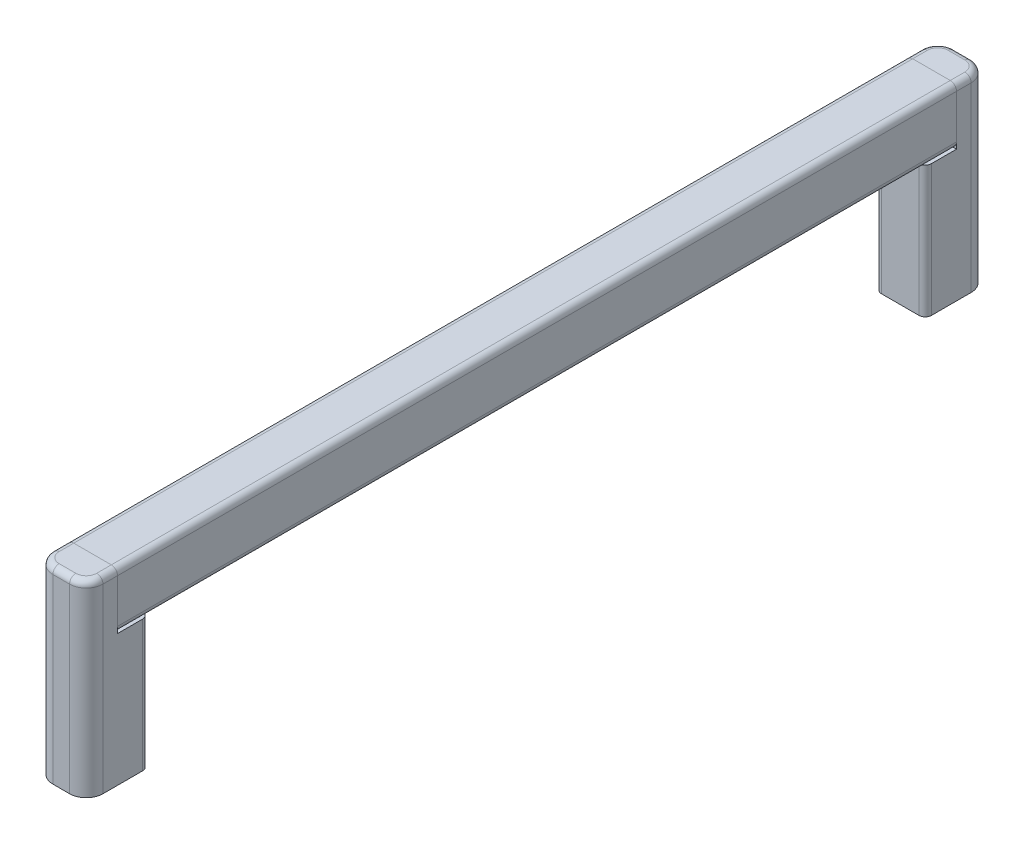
ISO-10303-21;
HEADER;
FILE_DESCRIPTION(('STEP AP214'),'2;1');
FILE_NAME('part.step','',(''),(''),'','','');
FILE_SCHEMA(('AUTOMOTIVE_DESIGN { 1 0 10303 214 1 1 1 1 }'));
ENDSEC;
DATA;
#1=APPLICATION_CONTEXT('core data for automotive mechanical design processes');
#2=APPLICATION_PROTOCOL_DEFINITION('international standard','automotive_design',2000,#1);
#3=PRODUCT_CONTEXT('',#1,'mechanical');
#4=PRODUCT('Part','Part','',(#3));
#5=PRODUCT_RELATED_PRODUCT_CATEGORY('part','',(#4));
#6=PRODUCT_DEFINITION_FORMATION('','',#4);
#7=PRODUCT_DEFINITION_CONTEXT('part definition',#1,'design');
#8=PRODUCT_DEFINITION('design','',#6,#7);
#9=PRODUCT_DEFINITION_SHAPE('','',#8);
#10=(LENGTH_UNIT() NAMED_UNIT(*) SI_UNIT(.MILLI.,.METRE.));
#11=(NAMED_UNIT(*) PLANE_ANGLE_UNIT() SI_UNIT($,.RADIAN.));
#12=(NAMED_UNIT(*) SI_UNIT($,.STERADIAN.) SOLID_ANGLE_UNIT());
#13=UNCERTAINTY_MEASURE_WITH_UNIT(LENGTH_MEASURE(1.E-05),#10,'distance_accuracy_value','');
#14=(GEOMETRIC_REPRESENTATION_CONTEXT(3) GLOBAL_UNCERTAINTY_ASSIGNED_CONTEXT((#13)) GLOBAL_UNIT_ASSIGNED_CONTEXT((#10,
#11,#12)) REPRESENTATION_CONTEXT('',''));
#15=CARTESIAN_POINT('',(0.,0.,0.));
#16=DIRECTION('',(0.,0.,1.));
#17=DIRECTION('',(1.,0.,0.));
#18=AXIS2_PLACEMENT_3D('',#15,#16,#17);
#19=CARTESIAN_POINT('',(-3.,3.50000000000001,67.));
#20=DIRECTION('',(0.,0.,1.));
#21=DIRECTION('',(1.,0.,0.));
#22=AXIS2_PLACEMENT_3D('',#19,#20,#21);
#23=PLANE('',#22);
#24=CARTESIAN_POINT('',(-3.,3.50000000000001,67.));
#25=DIRECTION('',(0.,0.,1.));
#26=DIRECTION('',(1.,0.,0.));
#27=AXIS2_PLACEMENT_3D('',#24,#25,#26);
#28=CIRCLE('',#27,1.);
#29=CARTESIAN_POINT('',(-3.,4.50000000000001,67.));
#30=VERTEX_POINT('',#29);
#31=CARTESIAN_POINT('',(-4.,3.50000000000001,67.));
#32=VERTEX_POINT('',#31);
#33=EDGE_CURVE('P0_E140',#30,#32,#28,.T.);
#34=ORIENTED_EDGE('',*,*,#33,.T.);
#35=DIRECTION('',(0.,-1.,0.));
#36=VECTOR('',#35,1.);
#37=CARTESIAN_POINT('',(-4.,3.50000000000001,67.));
#38=LINE('',#37,#36);
#39=CARTESIAN_POINT('',(-4.,-3.49999999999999,67.));
#40=VERTEX_POINT('',#39);
#41=EDGE_CURVE('P0_E129',#32,#40,#38,.T.);
#42=ORIENTED_EDGE('',*,*,#41,.T.);
#43=CARTESIAN_POINT('',(-3.,-3.49999999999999,67.));
#44=DIRECTION('',(0.,0.,1.));
#45=DIRECTION('',(1.,0.,0.));
#46=AXIS2_PLACEMENT_3D('',#43,#44,#45);
#47=CIRCLE('',#46,1.);
#48=CARTESIAN_POINT('',(-3.,-4.49999999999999,67.));
#49=VERTEX_POINT('',#48);
#50=EDGE_CURVE('P0_E139',#40,#49,#47,.T.);
#51=ORIENTED_EDGE('',*,*,#50,.T.);
#52=DIRECTION('',(1.,0.,0.));
#53=VECTOR('',#52,1.);
#54=CARTESIAN_POINT('',(-3.,-4.49999999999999,67.));
#55=LINE('',#54,#53);
#56=CARTESIAN_POINT('',(3.,-4.49999999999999,67.));
#57=VERTEX_POINT('',#56);
#58=EDGE_CURVE('P0_E224',#49,#57,#55,.T.);
#59=ORIENTED_EDGE('',*,*,#58,.T.);
#60=CARTESIAN_POINT('',(3.,-3.49999999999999,67.));
#61=DIRECTION('',(0.,0.,1.));
#62=DIRECTION('',(1.,0.,0.));
#63=AXIS2_PLACEMENT_3D('',#60,#61,#62);
#64=CIRCLE('',#63,1.);
#65=CARTESIAN_POINT('',(4.,-3.49999999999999,67.));
#66=VERTEX_POINT('',#65);
#67=EDGE_CURVE('P0_E226',#57,#66,#64,.T.);
#68=ORIENTED_EDGE('',*,*,#67,.T.);
#69=DIRECTION('',(0.,1.,0.));
#70=VECTOR('',#69,1.);
#71=CARTESIAN_POINT('',(4.,3.50000000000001,67.));
#72=LINE('',#71,#70);
#73=CARTESIAN_POINT('',(4.,3.50000000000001,67.));
#74=VERTEX_POINT('',#73);
#75=EDGE_CURVE('P0_E228',#66,#74,#72,.T.);
#76=ORIENTED_EDGE('',*,*,#75,.T.);
#77=CARTESIAN_POINT('',(3.,3.50000000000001,67.));
#78=DIRECTION('',(0.,0.,1.));
#79=DIRECTION('',(-1.,0.,0.));
#80=AXIS2_PLACEMENT_3D('',#77,#78,#79);
#81=CIRCLE('',#80,1.);
#82=CARTESIAN_POINT('',(3.,4.50000000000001,67.));
#83=VERTEX_POINT('',#82);
#84=EDGE_CURVE('P0_E230',#74,#83,#81,.T.);
#85=ORIENTED_EDGE('',*,*,#84,.T.);
#86=DIRECTION('',(-1.,0.,0.));
#87=VECTOR('',#86,1.);
#88=CARTESIAN_POINT('',(-3.,4.50000000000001,67.));
#89=LINE('',#88,#87);
#90=EDGE_CURVE('P0_E144',#83,#30,#89,.T.);
#91=ORIENTED_EDGE('',*,*,#90,.T.);
#92=EDGE_LOOP('',(#34,#42,#51,#59,#68,#76,#85,#91));
#93=FACE_BOUND('',#92,.T.);
#94=DIRECTION('',(-1.,0.,0.));
#95=VECTOR('',#94,1.);
#96=CARTESIAN_POINT('',(-1.33333333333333,1.5,67.));
#97=LINE('',#96,#95);
#98=CARTESIAN_POINT('',(0.833333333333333,1.5,67.));
#99=VERTEX_POINT('',#98);
#100=CARTESIAN_POINT('',(-0.833333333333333,1.5,67.));
#101=VERTEX_POINT('',#100);
#102=EDGE_CURVE('P0_E206',#99,#101,#97,.T.);
#103=ORIENTED_EDGE('',*,*,#102,.F.);
#104=CARTESIAN_POINT('',(0.833333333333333,1.,67.));
#105=DIRECTION('',(0.,0.,1.));
#106=DIRECTION('',(1.,0.,0.));
#107=AXIS2_PLACEMENT_3D('',#104,#105,#106);
#108=CIRCLE('',#107,0.5);
#109=CARTESIAN_POINT('',(1.33333333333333,1.,67.));
#110=VERTEX_POINT('',#109);
#111=EDGE_CURVE('P0_E187',#99,#110,#108,.F.);
#112=ORIENTED_EDGE('',*,*,#111,.T.);
#113=DIRECTION('',(0.,1.,0.));
#114=VECTOR('',#113,1.);
#115=CARTESIAN_POINT('',(1.33333333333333,-1.5,67.));
#116=LINE('',#115,#114);
#117=CARTESIAN_POINT('',(1.33333333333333,-0.999999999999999,67.));
#118=VERTEX_POINT('',#117);
#119=EDGE_CURVE('P0_E209',#118,#110,#116,.T.);
#120=ORIENTED_EDGE('',*,*,#119,.F.);
#121=CARTESIAN_POINT('',(0.833333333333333,-0.999999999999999,67.));
#122=DIRECTION('',(0.,0.,1.));
#123=DIRECTION('',(1.,0.,0.));
#124=AXIS2_PLACEMENT_3D('',#121,#122,#123);
#125=CIRCLE('',#124,0.5);
#126=CARTESIAN_POINT('',(0.833333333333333,-1.5,67.));
#127=VERTEX_POINT('',#126);
#128=EDGE_CURVE('P0_E183',#118,#127,#125,.F.);
#129=ORIENTED_EDGE('',*,*,#128,.T.);
#130=DIRECTION('',(1.,0.,0.));
#131=VECTOR('',#130,1.);
#132=CARTESIAN_POINT('',(-1.33333333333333,-1.5,67.));
#133=LINE('',#132,#131);
#134=CARTESIAN_POINT('',(-0.833333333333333,-1.5,67.));
#135=VERTEX_POINT('',#134);
#136=EDGE_CURVE('P0_E211',#135,#127,#133,.T.);
#137=ORIENTED_EDGE('',*,*,#136,.F.);
#138=CARTESIAN_POINT('',(-0.833333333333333,-0.999999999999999,67.));
#139=DIRECTION('',(0.,0.,1.));
#140=DIRECTION('',(1.,0.,0.));
#141=AXIS2_PLACEMENT_3D('',#138,#139,#140);
#142=CIRCLE('',#141,0.5);
#143=CARTESIAN_POINT('',(-1.33333333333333,-0.999999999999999,67.));
#144=VERTEX_POINT('',#143);
#145=EDGE_CURVE('P0_E179',#135,#144,#142,.F.);
#146=ORIENTED_EDGE('',*,*,#145,.T.);
#147=DIRECTION('',(0.,-1.,0.));
#148=VECTOR('',#147,1.);
#149=CARTESIAN_POINT('',(-1.33333333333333,-1.5,67.));
#150=LINE('',#149,#148);
#151=CARTESIAN_POINT('',(-1.33333333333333,1.,67.));
#152=VERTEX_POINT('',#151);
#153=EDGE_CURVE('P0_E208',#152,#144,#150,.T.);
#154=ORIENTED_EDGE('',*,*,#153,.F.);
#155=CARTESIAN_POINT('',(-0.833333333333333,0.999999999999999,67.));
#156=DIRECTION('',(0.,0.,1.));
#157=DIRECTION('',(1.,0.,0.));
#158=AXIS2_PLACEMENT_3D('',#155,#156,#157);
#159=CIRCLE('',#158,0.5);
#160=EDGE_CURVE('P0_E11',#152,#101,#159,.F.);
#161=ORIENTED_EDGE('',*,*,#160,.T.);
#162=EDGE_LOOP('',(#103,#112,#120,#129,#137,#146,#154,#161));
#163=FACE_BOUND('',#162,.T.);
#164=ADVANCED_FACE('P0_F16',(#93,#163),#23,.T.);
#165=CARTESIAN_POINT('',(-3.,3.50000000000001,-67.));
#166=DIRECTION('',(0.,0.,1.));
#167=DIRECTION('',(1.,0.,0.));
#168=AXIS2_PLACEMENT_3D('',#165,#166,#167);
#169=PLANE('',#168);
#170=CARTESIAN_POINT('',(-3.,3.50000000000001,-67.));
#171=DIRECTION('',(0.,0.,1.));
#172=DIRECTION('',(1.,0.,0.));
#173=AXIS2_PLACEMENT_3D('',#170,#171,#172);
#174=CIRCLE('',#173,1.);
#175=CARTESIAN_POINT('',(-3.,4.50000000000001,-67.));
#176=VERTEX_POINT('',#175);
#177=CARTESIAN_POINT('',(-4.,3.50000000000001,-67.));
#178=VERTEX_POINT('',#177);
#179=EDGE_CURVE('P0_E152',#176,#178,#174,.T.);
#180=ORIENTED_EDGE('',*,*,#179,.F.);
#181=DIRECTION('',(-1.,0.,0.));
#182=VECTOR('',#181,1.);
#183=CARTESIAN_POINT('',(-3.,4.50000000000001,-67.));
#184=LINE('',#183,#182);
#185=CARTESIAN_POINT('',(3.,4.50000000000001,-67.));
#186=VERTEX_POINT('',#185);
#187=EDGE_CURVE('P0_E148',#186,#176,#184,.T.);
#188=ORIENTED_EDGE('',*,*,#187,.F.);
#189=CARTESIAN_POINT('',(3.,3.50000000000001,-67.));
#190=DIRECTION('',(0.,0.,1.));
#191=DIRECTION('',(-1.,0.,0.));
#192=AXIS2_PLACEMENT_3D('',#189,#190,#191);
#193=CIRCLE('',#192,1.);
#194=CARTESIAN_POINT('',(4.,3.50000000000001,-67.));
#195=VERTEX_POINT('',#194);
#196=EDGE_CURVE('P0_E245',#195,#186,#193,.T.);
#197=ORIENTED_EDGE('',*,*,#196,.F.);
#198=DIRECTION('',(0.,1.,0.));
#199=VECTOR('',#198,1.);
#200=CARTESIAN_POINT('',(4.,3.50000000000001,-67.));
#201=LINE('',#200,#199);
#202=CARTESIAN_POINT('',(4.,-3.49999999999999,-67.));
#203=VERTEX_POINT('',#202);
#204=EDGE_CURVE('P0_E243',#203,#195,#201,.T.);
#205=ORIENTED_EDGE('',*,*,#204,.F.);
#206=CARTESIAN_POINT('',(3.,-3.49999999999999,-67.));
#207=DIRECTION('',(0.,0.,1.));
#208=DIRECTION('',(1.,0.,0.));
#209=AXIS2_PLACEMENT_3D('',#206,#207,#208);
#210=CIRCLE('',#209,1.);
#211=CARTESIAN_POINT('',(3.,-4.49999999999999,-67.));
#212=VERTEX_POINT('',#211);
#213=EDGE_CURVE('P0_E241',#212,#203,#210,.T.);
#214=ORIENTED_EDGE('',*,*,#213,.F.);
#215=DIRECTION('',(1.,0.,0.));
#216=VECTOR('',#215,1.);
#217=CARTESIAN_POINT('',(-3.,-4.49999999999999,-67.));
#218=LINE('',#217,#216);
#219=CARTESIAN_POINT('',(-3.,-4.49999999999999,-67.));
#220=VERTEX_POINT('',#219);
#221=EDGE_CURVE('P0_E239',#220,#212,#218,.T.);
#222=ORIENTED_EDGE('',*,*,#221,.F.);
#223=CARTESIAN_POINT('',(-3.,-3.49999999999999,-67.));
#224=DIRECTION('',(0.,0.,1.));
#225=DIRECTION('',(1.,0.,0.));
#226=AXIS2_PLACEMENT_3D('',#223,#224,#225);
#227=CIRCLE('',#226,1.);
#228=CARTESIAN_POINT('',(-4.,-3.49999999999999,-67.));
#229=VERTEX_POINT('',#228);
#230=EDGE_CURVE('P0_E237',#229,#220,#227,.T.);
#231=ORIENTED_EDGE('',*,*,#230,.F.);
#232=DIRECTION('',(0.,-1.,0.));
#233=VECTOR('',#232,1.);
#234=CARTESIAN_POINT('',(-4.,3.50000000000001,-67.));
#235=LINE('',#234,#233);
#236=EDGE_CURVE('P0_E235',#178,#229,#235,.T.);
#237=ORIENTED_EDGE('',*,*,#236,.F.);
#238=EDGE_LOOP('',(#180,#188,#197,#205,#214,#222,#231,#237));
#239=FACE_BOUND('',#238,.T.);
#240=DIRECTION('',(1.,0.,0.));
#241=VECTOR('',#240,1.);
#242=CARTESIAN_POINT('',(-1.33333333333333,-1.5,-67.));
#243=LINE('',#242,#241);
#244=CARTESIAN_POINT('',(-0.833333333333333,-1.5,-67.));
#245=VERTEX_POINT('',#244);
#246=CARTESIAN_POINT('',(0.833333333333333,-1.5,-67.));
#247=VERTEX_POINT('',#246);
#248=EDGE_CURVE('P0_E203',#245,#247,#243,.T.);
#249=ORIENTED_EDGE('',*,*,#248,.T.);
#250=CARTESIAN_POINT('',(0.833333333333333,-0.999999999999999,-67.));
#251=DIRECTION('',(0.,0.,1.));
#252=DIRECTION('',(1.,0.,0.));
#253=AXIS2_PLACEMENT_3D('',#250,#251,#252);
#254=CIRCLE('',#253,0.5);
#255=CARTESIAN_POINT('',(1.33333333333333,-0.999999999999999,-67.));
#256=VERTEX_POINT('',#255);
#257=EDGE_CURVE('P0_E181',#247,#256,#254,.T.);
#258=ORIENTED_EDGE('',*,*,#257,.T.);
#259=DIRECTION('',(0.,1.,0.));
#260=VECTOR('',#259,1.);
#261=CARTESIAN_POINT('',(1.33333333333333,-1.5,-67.));
#262=LINE('',#261,#260);
#263=CARTESIAN_POINT('',(1.33333333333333,1.,-67.));
#264=VERTEX_POINT('',#263);
#265=EDGE_CURVE('P0_E218',#256,#264,#262,.T.);
#266=ORIENTED_EDGE('',*,*,#265,.T.);
#267=CARTESIAN_POINT('',(0.833333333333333,1.,-67.));
#268=DIRECTION('',(0.,0.,1.));
#269=DIRECTION('',(1.,0.,0.));
#270=AXIS2_PLACEMENT_3D('',#267,#268,#269);
#271=CIRCLE('',#270,0.5);
#272=CARTESIAN_POINT('',(0.833333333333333,1.5,-67.));
#273=VERTEX_POINT('',#272);
#274=EDGE_CURVE('P0_E185',#264,#273,#271,.T.);
#275=ORIENTED_EDGE('',*,*,#274,.T.);
#276=DIRECTION('',(-1.,0.,0.));
#277=VECTOR('',#276,1.);
#278=CARTESIAN_POINT('',(-1.33333333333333,1.5,-67.));
#279=LINE('',#278,#277);
#280=CARTESIAN_POINT('',(-0.833333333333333,1.5,-67.));
#281=VERTEX_POINT('',#280);
#282=EDGE_CURVE('P0_E195',#273,#281,#279,.T.);
#283=ORIENTED_EDGE('',*,*,#282,.T.);
#284=CARTESIAN_POINT('',(-0.833333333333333,0.999999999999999,-67.));
#285=DIRECTION('',(0.,0.,1.));
#286=DIRECTION('',(1.,0.,0.));
#287=AXIS2_PLACEMENT_3D('',#284,#285,#286);
#288=CIRCLE('',#287,0.5);
#289=CARTESIAN_POINT('',(-1.33333333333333,1.,-67.));
#290=VERTEX_POINT('',#289);
#291=EDGE_CURVE('P0_E24',#281,#290,#288,.T.);
#292=ORIENTED_EDGE('',*,*,#291,.T.);
#293=DIRECTION('',(0.,-1.,0.));
#294=VECTOR('',#293,1.);
#295=CARTESIAN_POINT('',(-1.33333333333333,-1.5,-67.));
#296=LINE('',#295,#294);
#297=CARTESIAN_POINT('',(-1.33333333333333,-0.999999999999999,-67.));
#298=VERTEX_POINT('',#297);
#299=EDGE_CURVE('P0_E194',#290,#298,#296,.T.);
#300=ORIENTED_EDGE('',*,*,#299,.T.);
#301=CARTESIAN_POINT('',(-0.833333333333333,-0.999999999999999,-67.));
#302=DIRECTION('',(0.,0.,1.));
#303=DIRECTION('',(1.,0.,0.));
#304=AXIS2_PLACEMENT_3D('',#301,#302,#303);
#305=CIRCLE('',#304,0.5);
#306=EDGE_CURVE('P0_E177',#298,#245,#305,.T.);
#307=ORIENTED_EDGE('',*,*,#306,.T.);
#308=EDGE_LOOP('',(#249,#258,#266,#275,#283,#292,#300,#307));
#309=FACE_BOUND('',#308,.T.);
#310=ADVANCED_FACE('P0_F193',(#239,#309),#169,.F.);
#311=CARTESIAN_POINT('',(-3.,3.50000000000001,67.));
#312=DIRECTION('',(0.,0.,-1.));
#313=DIRECTION('',(-1.,0.,0.));
#314=AXIS2_PLACEMENT_3D('',#311,#312,#313);
#315=CYLINDRICAL_SURFACE('',#314,1.);
#316=ORIENTED_EDGE('',*,*,#179,.T.);
#317=DIRECTION('',(0.,0.,-1.));
#318=VECTOR('',#317,1.);
#319=CARTESIAN_POINT('',(-4.,3.50000000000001,67.));
#320=LINE('',#319,#318);
#321=EDGE_CURVE('P0_E133',#32,#178,#320,.T.);
#322=ORIENTED_EDGE('',*,*,#321,.F.);
#323=ORIENTED_EDGE('',*,*,#33,.F.);
#324=DIRECTION('',(0.,0.,-1.));
#325=VECTOR('',#324,1.);
#326=CARTESIAN_POINT('',(-3.,4.50000000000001,67.));
#327=LINE('',#326,#325);
#328=EDGE_CURVE('P0_E233',#30,#176,#327,.T.);
#329=ORIENTED_EDGE('',*,*,#328,.T.);
#330=EDGE_LOOP('',(#316,#322,#323,#329));
#331=FACE_BOUND('',#330,.T.);
#332=ADVANCED_FACE('P0_F150',(#331),#315,.T.);
#333=CARTESIAN_POINT('',(-4.,3.50000000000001,67.));
#334=DIRECTION('',(1.,0.,0.));
#335=DIRECTION('',(0.,0.,-1.));
#336=AXIS2_PLACEMENT_3D('',#333,#334,#335);
#337=PLANE('',#336);
#338=ORIENTED_EDGE('',*,*,#236,.T.);
#339=DIRECTION('',(0.,0.,-1.));
#340=VECTOR('',#339,1.);
#341=CARTESIAN_POINT('',(-4.,-3.49999999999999,67.));
#342=LINE('',#341,#340);
#343=EDGE_CURVE('P0_E136',#40,#229,#342,.T.);
#344=ORIENTED_EDGE('',*,*,#343,.F.);
#345=ORIENTED_EDGE('',*,*,#41,.F.);
#346=ORIENTED_EDGE('',*,*,#321,.T.);
#347=EDGE_LOOP('',(#338,#344,#345,#346));
#348=FACE_BOUND('',#347,.T.);
#349=ADVANCED_FACE('P0_F131',(#348),#337,.F.);
#350=CARTESIAN_POINT('',(-3.,-3.49999999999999,67.));
#351=DIRECTION('',(0.,0.,-1.));
#352=DIRECTION('',(-1.,0.,0.));
#353=AXIS2_PLACEMENT_3D('',#350,#351,#352);
#354=CYLINDRICAL_SURFACE('',#353,1.);
#355=ORIENTED_EDGE('',*,*,#230,.T.);
#356=DIRECTION('',(0.,0.,-1.));
#357=VECTOR('',#356,1.);
#358=CARTESIAN_POINT('',(-3.,-4.49999999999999,67.));
#359=LINE('',#358,#357);
#360=EDGE_CURVE('P0_E157',#49,#220,#359,.T.);
#361=ORIENTED_EDGE('',*,*,#360,.F.);
#362=ORIENTED_EDGE('',*,*,#50,.F.);
#363=ORIENTED_EDGE('',*,*,#343,.T.);
#364=EDGE_LOOP('',(#355,#361,#362,#363));
#365=FACE_BOUND('',#364,.T.);
#366=ADVANCED_FACE('P0_F283',(#365),#354,.T.);
#367=CARTESIAN_POINT('',(-3.,-4.49999999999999,67.));
#368=DIRECTION('',(0.,1.,0.));
#369=DIRECTION('',(0.,0.,1.));
#370=AXIS2_PLACEMENT_3D('',#367,#368,#369);
#371=PLANE('',#370);
#372=ORIENTED_EDGE('',*,*,#221,.T.);
#373=DIRECTION('',(0.,0.,-1.));
#374=VECTOR('',#373,1.);
#375=CARTESIAN_POINT('',(3.,-4.49999999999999,67.));
#376=LINE('',#375,#374);
#377=EDGE_CURVE('P0_E258',#57,#212,#376,.T.);
#378=ORIENTED_EDGE('',*,*,#377,.F.);
#379=ORIENTED_EDGE('',*,*,#58,.F.);
#380=ORIENTED_EDGE('',*,*,#360,.T.);
#381=EDGE_LOOP('',(#372,#378,#379,#380));
#382=FACE_BOUND('',#381,.T.);
#383=ADVANCED_FACE('P0_F265',(#382),#371,.F.);
#384=CARTESIAN_POINT('',(3.,-3.49999999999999,67.));
#385=DIRECTION('',(0.,0.,-1.));
#386=DIRECTION('',(-1.,0.,0.));
#387=AXIS2_PLACEMENT_3D('',#384,#385,#386);
#388=CYLINDRICAL_SURFACE('',#387,1.);
#389=ORIENTED_EDGE('',*,*,#213,.T.);
#390=DIRECTION('',(0.,0.,-1.));
#391=VECTOR('',#390,1.);
#392=CARTESIAN_POINT('',(4.,-3.49999999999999,67.));
#393=LINE('',#392,#391);
#394=EDGE_CURVE('P0_E255',#66,#203,#393,.T.);
#395=ORIENTED_EDGE('',*,*,#394,.F.);
#396=ORIENTED_EDGE('',*,*,#67,.F.);
#397=ORIENTED_EDGE('',*,*,#377,.T.);
#398=EDGE_LOOP('',(#389,#395,#396,#397));
#399=FACE_BOUND('',#398,.T.);
#400=ADVANCED_FACE('P0_F275',(#399),#388,.T.);
#401=CARTESIAN_POINT('',(4.,3.50000000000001,67.));
#402=DIRECTION('',(-1.,0.,0.));
#403=DIRECTION('',(0.,0.,1.));
#404=AXIS2_PLACEMENT_3D('',#401,#402,#403);
#405=PLANE('',#404);
#406=ORIENTED_EDGE('',*,*,#204,.T.);
#407=DIRECTION('',(0.,0.,-1.));
#408=VECTOR('',#407,1.);
#409=CARTESIAN_POINT('',(4.,3.50000000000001,67.));
#410=LINE('',#409,#408);
#411=EDGE_CURVE('P0_E252',#74,#195,#410,.T.);
#412=ORIENTED_EDGE('',*,*,#411,.F.);
#413=ORIENTED_EDGE('',*,*,#75,.F.);
#414=ORIENTED_EDGE('',*,*,#394,.T.);
#415=EDGE_LOOP('',(#406,#412,#413,#414));
#416=FACE_BOUND('',#415,.T.);
#417=ADVANCED_FACE('P0_F279',(#416),#405,.F.);
#418=CARTESIAN_POINT('',(3.,3.50000000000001,67.));
#419=DIRECTION('',(0.,0.,-1.));
#420=DIRECTION('',(-1.,0.,0.));
#421=AXIS2_PLACEMENT_3D('',#418,#419,#420);
#422=CYLINDRICAL_SURFACE('',#421,1.);
#423=ORIENTED_EDGE('',*,*,#196,.T.);
#424=DIRECTION('',(0.,0.,-1.));
#425=VECTOR('',#424,1.);
#426=CARTESIAN_POINT('',(3.,4.50000000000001,67.));
#427=LINE('',#426,#425);
#428=EDGE_CURVE('P0_E249',#83,#186,#427,.T.);
#429=ORIENTED_EDGE('',*,*,#428,.F.);
#430=ORIENTED_EDGE('',*,*,#84,.F.);
#431=ORIENTED_EDGE('',*,*,#411,.T.);
#432=EDGE_LOOP('',(#423,#429,#430,#431));
#433=FACE_BOUND('',#432,.T.);
#434=ADVANCED_FACE('P0_F306',(#433),#422,.T.);
#435=CARTESIAN_POINT('',(-3.,4.50000000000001,67.));
#436=DIRECTION('',(0.,-1.,0.));
#437=DIRECTION('',(0.,0.,-1.));
#438=AXIS2_PLACEMENT_3D('',#435,#436,#437);
#439=PLANE('',#438);
#440=ORIENTED_EDGE('',*,*,#187,.T.);
#441=ORIENTED_EDGE('',*,*,#328,.F.);
#442=ORIENTED_EDGE('',*,*,#90,.F.);
#443=ORIENTED_EDGE('',*,*,#428,.T.);
#444=EDGE_LOOP('',(#440,#441,#442,#443));
#445=FACE_BOUND('',#444,.T.);
#446=ADVANCED_FACE('P0_F303',(#445),#439,.F.);
#447=CARTESIAN_POINT('',(1.33333333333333,-1.5,67.));
#448=DIRECTION('',(-1.,0.,0.));
#449=DIRECTION('',(0.,0.,1.));
#450=AXIS2_PLACEMENT_3D('',#447,#448,#449);
#451=PLANE('',#450);
#452=ORIENTED_EDGE('',*,*,#265,.F.);
#453=DIRECTION('',(0.,0.,-1.));
#454=VECTOR('',#453,1.);
#455=CARTESIAN_POINT('',(1.33333333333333,-0.999999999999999,67.));
#456=LINE('',#455,#454);
#457=EDGE_CURVE('P0_E171',#256,#118,#456,.F.);
#458=ORIENTED_EDGE('',*,*,#457,.T.);
#459=ORIENTED_EDGE('',*,*,#119,.T.);
#460=DIRECTION('',(0.,0.,-1.));
#461=VECTOR('',#460,1.);
#462=CARTESIAN_POINT('',(1.33333333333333,1.,-67.));
#463=LINE('',#462,#461);
#464=EDGE_CURVE('P0_E168',#110,#264,#463,.T.);
#465=ORIENTED_EDGE('',*,*,#464,.T.);
#466=EDGE_LOOP('',(#452,#458,#459,#465));
#467=FACE_BOUND('',#466,.T.);
#468=ADVANCED_FACE('P0_F300',(#467),#451,.T.);
#469=CARTESIAN_POINT('',(-1.33333333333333,1.5,67.));
#470=DIRECTION('',(0.,-1.,0.));
#471=DIRECTION('',(1.,0.,0.));
#472=AXIS2_PLACEMENT_3D('',#469,#470,#471);
#473=PLANE('',#472);
#474=ORIENTED_EDGE('',*,*,#282,.F.);
#475=DIRECTION('',(0.,0.,-1.));
#476=VECTOR('',#475,1.);
#477=CARTESIAN_POINT('',(0.833333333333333,1.5,67.));
#478=LINE('',#477,#476);
#479=EDGE_CURVE('P0_E36',#273,#99,#478,.F.);
#480=ORIENTED_EDGE('',*,*,#479,.T.);
#481=ORIENTED_EDGE('',*,*,#102,.T.);
#482=DIRECTION('',(0.,0.,-1.));
#483=VECTOR('',#482,1.);
#484=CARTESIAN_POINT('',(-0.833333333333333,1.5,-67.));
#485=LINE('',#484,#483);
#486=EDGE_CURVE('P0_E173',#101,#281,#485,.T.);
#487=ORIENTED_EDGE('',*,*,#486,.T.);
#488=EDGE_LOOP('',(#474,#480,#481,#487));
#489=FACE_BOUND('',#488,.T.);
#490=ADVANCED_FACE('P0_F205',(#489),#473,.T.);
#491=CARTESIAN_POINT('',(-1.33333333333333,-1.5,67.));
#492=DIRECTION('',(1.,0.,0.));
#493=DIRECTION('',(0.,0.,-1.));
#494=AXIS2_PLACEMENT_3D('',#491,#492,#493);
#495=PLANE('',#494);
#496=ORIENTED_EDGE('',*,*,#153,.T.);
#497=DIRECTION('',(0.,0.,-1.));
#498=VECTOR('',#497,1.);
#499=CARTESIAN_POINT('',(-1.33333333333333,-0.999999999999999,-67.));
#500=LINE('',#499,#498);
#501=EDGE_CURVE('P0_E155',#144,#298,#500,.T.);
#502=ORIENTED_EDGE('',*,*,#501,.T.);
#503=ORIENTED_EDGE('',*,*,#299,.F.);
#504=DIRECTION('',(0.,0.,-1.));
#505=VECTOR('',#504,1.);
#506=CARTESIAN_POINT('',(-1.33333333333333,0.999999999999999,67.));
#507=LINE('',#506,#505);
#508=EDGE_CURVE('P0_E153',#290,#152,#507,.F.);
#509=ORIENTED_EDGE('',*,*,#508,.T.);
#510=EDGE_LOOP('',(#496,#502,#503,#509));
#511=FACE_BOUND('',#510,.T.);
#512=ADVANCED_FACE('P0_F201',(#511),#495,.T.);
#513=CARTESIAN_POINT('',(-1.33333333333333,-1.5,67.));
#514=DIRECTION('',(0.,1.,0.));
#515=DIRECTION('',(0.,0.,1.));
#516=AXIS2_PLACEMENT_3D('',#513,#514,#515);
#517=PLANE('',#516);
#518=ORIENTED_EDGE('',*,*,#248,.F.);
#519=DIRECTION('',(0.,0.,-1.));
#520=VECTOR('',#519,1.);
#521=CARTESIAN_POINT('',(-0.833333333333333,-1.5,67.));
#522=LINE('',#521,#520);
#523=EDGE_CURVE('P0_E166',#245,#135,#522,.F.);
#524=ORIENTED_EDGE('',*,*,#523,.T.);
#525=ORIENTED_EDGE('',*,*,#136,.T.);
#526=DIRECTION('',(0.,0.,-1.));
#527=VECTOR('',#526,1.);
#528=CARTESIAN_POINT('',(0.833333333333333,-1.5,-67.));
#529=LINE('',#528,#527);
#530=EDGE_CURVE('P0_E163',#127,#247,#529,.T.);
#531=ORIENTED_EDGE('',*,*,#530,.T.);
#532=EDGE_LOOP('',(#518,#524,#525,#531));
#533=FACE_BOUND('',#532,.T.);
#534=ADVANCED_FACE('P0_F355',(#533),#517,.T.);
#535=CARTESIAN_POINT('',(-0.833333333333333,-0.999999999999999,67.));
#536=DIRECTION('',(0.,0.,1.));
#537=DIRECTION('',(1.,0.,0.));
#538=AXIS2_PLACEMENT_3D('',#535,#536,#537);
#539=CYLINDRICAL_SURFACE('',#538,0.5);
#540=ORIENTED_EDGE('',*,*,#145,.F.);
#541=ORIENTED_EDGE('',*,*,#523,.F.);
#542=ORIENTED_EDGE('',*,*,#306,.F.);
#543=ORIENTED_EDGE('',*,*,#501,.F.);
#544=EDGE_LOOP('',(#540,#541,#542,#543));
#545=FACE_BOUND('',#544,.T.);
#546=ADVANCED_FACE('P0_F363',(#545),#539,.F.);
#547=CARTESIAN_POINT('',(0.833333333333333,-0.999999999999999,67.));
#548=DIRECTION('',(0.,0.,1.));
#549=DIRECTION('',(1.,0.,0.));
#550=AXIS2_PLACEMENT_3D('',#547,#548,#549);
#551=CYLINDRICAL_SURFACE('',#550,0.5);
#552=ORIENTED_EDGE('',*,*,#128,.F.);
#553=ORIENTED_EDGE('',*,*,#457,.F.);
#554=ORIENTED_EDGE('',*,*,#257,.F.);
#555=ORIENTED_EDGE('',*,*,#530,.F.);
#556=EDGE_LOOP('',(#552,#553,#554,#555));
#557=FACE_BOUND('',#556,.T.);
#558=ADVANCED_FACE('P0_F372',(#557),#551,.F.);
#559=CARTESIAN_POINT('',(0.833333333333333,1.,67.));
#560=DIRECTION('',(0.,0.,1.));
#561=DIRECTION('',(1.,0.,0.));
#562=AXIS2_PLACEMENT_3D('',#559,#560,#561);
#563=CYLINDRICAL_SURFACE('',#562,0.5);
#564=ORIENTED_EDGE('',*,*,#111,.F.);
#565=ORIENTED_EDGE('',*,*,#479,.F.);
#566=ORIENTED_EDGE('',*,*,#274,.F.);
#567=ORIENTED_EDGE('',*,*,#464,.F.);
#568=EDGE_LOOP('',(#564,#565,#566,#567));
#569=FACE_BOUND('',#568,.T.);
#570=ADVANCED_FACE('P0_F381',(#569),#563,.F.);
#571=CARTESIAN_POINT('',(-0.833333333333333,0.999999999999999,67.));
#572=DIRECTION('',(0.,0.,1.));
#573=DIRECTION('',(1.,0.,0.));
#574=AXIS2_PLACEMENT_3D('',#571,#572,#573);
#575=CYLINDRICAL_SURFACE('',#574,0.5);
#576=ORIENTED_EDGE('',*,*,#160,.F.);
#577=ORIENTED_EDGE('',*,*,#508,.F.);
#578=ORIENTED_EDGE('',*,*,#291,.F.);
#579=ORIENTED_EDGE('',*,*,#486,.F.);
#580=EDGE_LOOP('',(#576,#577,#578,#579));
#581=FACE_BOUND('',#580,.T.);
#582=ADVANCED_FACE('P0_F18',(#581),#575,.F.);
#583=CLOSED_SHELL('',(#164,#310,#332,#349,#366,#383,#400,#417,#434,#446,#468,#490,#512,#534,
#546,#558,#570,#582));
#584=MANIFOLD_SOLID_BREP('P0_B1',#583);
#585=CARTESIAN_POINT('',(0.,-25.5,-67.));
#586=DIRECTION('',(0.,1.,0.));
#587=DIRECTION('',(-1.,0.,0.));
#588=AXIS2_PLACEMENT_3D('',#585,#586,#587);
#589=CYLINDRICAL_SURFACE('',#588,3.24999999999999);
#590=CARTESIAN_POINT('',(0.,-11.2769088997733,-67.));
#591=DIRECTION('',(0.,1.,0.));
#592=DIRECTION('',(-1.,0.,0.));
#593=AXIS2_PLACEMENT_3D('',#590,#591,#592);
#594=CIRCLE('',#593,3.24999999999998);
#595=CARTESIAN_POINT('',(-3.24999999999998,-11.2769088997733,-67.));
#596=VERTEX_POINT('',#595);
#597=EDGE_CURVE('P1_E11',#596,#596,#594,.T.);
#598=ORIENTED_EDGE('',*,*,#597,.F.);
#599=EDGE_LOOP('',(#598));
#600=FACE_BOUND('',#599,.T.);
#601=CARTESIAN_POINT('',(0.,-25.5,-67.));
#602=DIRECTION('',(0.,1.,0.));
#603=DIRECTION('',(-1.,0.,0.));
#604=AXIS2_PLACEMENT_3D('',#601,#602,#603);
#605=CIRCLE('',#604,3.25);
#606=CARTESIAN_POINT('',(-3.25,-25.5,-67.));
#607=VERTEX_POINT('',#606);
#608=EDGE_CURVE('P1_E51',#607,#607,#605,.T.);
#609=ORIENTED_EDGE('',*,*,#608,.T.);
#610=EDGE_LOOP('',(#609));
#611=FACE_BOUND('',#610,.T.);
#612=ADVANCED_FACE('P1_F16',(#600,#611),#589,.T.);
#613=CARTESIAN_POINT('',(0.,-11.2769088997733,-67.));
#614=DIRECTION('',(0.,1.,0.));
#615=DIRECTION('',(-1.,0.,0.));
#616=AXIS2_PLACEMENT_3D('',#613,#614,#615);
#617=TOROIDAL_SURFACE('',#616,2.25,0.999999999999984);
#618=CARTESIAN_POINT('',(0.,-10.2807142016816,-67.));
#619=DIRECTION('',(0.,1.,0.));
#620=DIRECTION('',(-1.,0.,0.));
#621=AXIS2_PLACEMENT_3D('',#618,#619,#620);
#622=CIRCLE('',#621,2.33715574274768);
#623=CARTESIAN_POINT('',(-2.33715574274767,-10.2807142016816,-67.));
#624=VERTEX_POINT('',#623);
#625=EDGE_CURVE('P1_E23',#624,#624,#622,.T.);
#626=ORIENTED_EDGE('',*,*,#625,.F.);
#627=EDGE_LOOP('',(#626));
#628=FACE_BOUND('',#627,.T.);
#629=ORIENTED_EDGE('',*,*,#597,.T.);
#630=EDGE_LOOP('',(#629));
#631=FACE_BOUND('',#630,.T.);
#632=ADVANCED_FACE('P1_F33',(#628,#631),#617,.T.);
#633=CARTESIAN_POINT('',(0.,-10.2807142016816,-67.));
#634=DIRECTION('',(0.,-1.,0.));
#635=DIRECTION('',(1.,0.,0.));
#636=AXIS2_PLACEMENT_3D('',#633,#634,#635);
#637=CONICAL_SURFACE('',#636,2.33715574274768,1.48352986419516);
#638=CARTESIAN_POINT('',(0.,-10.0762395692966,-67.));
#639=VERTEX_POINT('',#638);
#640=VERTEX_LOOP('',#639);
#641=FACE_BOUND('',#640,.T.);
#642=ORIENTED_EDGE('',*,*,#625,.T.);
#643=EDGE_LOOP('',(#642));
#644=FACE_BOUND('',#643,.T.);
#645=ADVANCED_FACE('P1_F29',(#641,#644),#637,.T.);
#646=CARTESIAN_POINT('',(0.,-13.5762395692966,-67.));
#647=DIRECTION('',(0.,-1.,0.));
#648=DIRECTION('',(1.,0.,0.));
#649=AXIS2_PLACEMENT_3D('',#646,#647,#648);
#650=CONICAL_SURFACE('',#649,0.,1.04719755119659);
#651=CARTESIAN_POINT('',(0.,-14.5,-67.));
#652=DIRECTION('',(0.,1.,0.));
#653=DIRECTION('',(-1.,0.,0.));
#654=AXIS2_PLACEMENT_3D('',#651,#652,#653);
#655=CIRCLE('',#654,1.6);
#656=CARTESIAN_POINT('',(-1.6,-14.5,-67.));
#657=VERTEX_POINT('',#656);
#658=EDGE_CURVE('P1_E38',#657,#657,#655,.T.);
#659=ORIENTED_EDGE('',*,*,#658,.F.);
#660=EDGE_LOOP('',(#659));
#661=FACE_BOUND('',#660,.T.);
#662=CARTESIAN_POINT('',(0.,-13.5762395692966,-67.));
#663=VERTEX_POINT('',#662);
#664=VERTEX_LOOP('',#663);
#665=FACE_BOUND('',#664,.T.);
#666=ADVANCED_FACE('P1_F32',(#661,#665),#650,.F.);
#667=CARTESIAN_POINT('',(0.,-25.5,-67.));
#668=DIRECTION('',(0.,1.,0.));
#669=DIRECTION('',(-1.,0.,0.));
#670=AXIS2_PLACEMENT_3D('',#667,#668,#669);
#671=CYLINDRICAL_SURFACE('',#670,1.6);
#672=CARTESIAN_POINT('',(0.,-17.5,-67.));
#673=DIRECTION('',(0.,1.,0.));
#674=DIRECTION('',(-1.,0.,0.));
#675=AXIS2_PLACEMENT_3D('',#672,#673,#674);
#676=CIRCLE('',#675,1.6);
#677=CARTESIAN_POINT('',(-1.6,-17.5,-67.));
#678=VERTEX_POINT('',#677);
#679=EDGE_CURVE('P1_E40',#678,#678,#676,.T.);
#680=ORIENTED_EDGE('',*,*,#679,.F.);
#681=EDGE_LOOP('',(#680));
#682=FACE_BOUND('',#681,.T.);
#683=ORIENTED_EDGE('',*,*,#658,.T.);
#684=EDGE_LOOP('',(#683));
#685=FACE_BOUND('',#684,.T.);
#686=ADVANCED_FACE('P1_F71',(#682,#685),#671,.F.);
#687=CARTESIAN_POINT('',(0.,-17.5,-65.));
#688=DIRECTION('',(0.,1.,0.));
#689=DIRECTION('',(-1.,0.,0.));
#690=AXIS2_PLACEMENT_3D('',#687,#688,#689);
#691=PLANE('',#690);
#692=CARTESIAN_POINT('',(0.,-17.5,-67.));
#693=DIRECTION('',(0.,1.,0.));
#694=DIRECTION('',(-1.,0.,0.));
#695=AXIS2_PLACEMENT_3D('',#692,#693,#694);
#696=CIRCLE('',#695,2.);
#697=CARTESIAN_POINT('',(-2.,-17.5,-67.));
#698=VERTEX_POINT('',#697);
#699=EDGE_CURVE('P1_E45',#698,#698,#696,.T.);
#700=ORIENTED_EDGE('',*,*,#699,.F.);
#701=EDGE_LOOP('',(#700));
#702=FACE_BOUND('',#701,.T.);
#703=ORIENTED_EDGE('',*,*,#679,.T.);
#704=EDGE_LOOP('',(#703));
#705=FACE_BOUND('',#704,.T.);
#706=ADVANCED_FACE('P1_F65',(#702,#705),#691,.F.);
#707=CARTESIAN_POINT('',(0.,-25.5,-67.));
#708=DIRECTION('',(0.,1.,0.));
#709=DIRECTION('',(-1.,0.,0.));
#710=AXIS2_PLACEMENT_3D('',#707,#708,#709);
#711=CYLINDRICAL_SURFACE('',#710,2.);
#712=CARTESIAN_POINT('',(0.,-25.5,-67.));
#713=DIRECTION('',(0.,1.,0.));
#714=DIRECTION('',(-1.,0.,0.));
#715=AXIS2_PLACEMENT_3D('',#712,#713,#714);
#716=CIRCLE('',#715,2.);
#717=CARTESIAN_POINT('',(-2.,-25.5,-67.));
#718=VERTEX_POINT('',#717);
#719=EDGE_CURVE('P1_E48',#718,#718,#716,.T.);
#720=ORIENTED_EDGE('',*,*,#719,.F.);
#721=EDGE_LOOP('',(#720));
#722=FACE_BOUND('',#721,.T.);
#723=ORIENTED_EDGE('',*,*,#699,.T.);
#724=EDGE_LOOP('',(#723));
#725=FACE_BOUND('',#724,.T.);
#726=ADVANCED_FACE('P1_F59',(#722,#725),#711,.F.);
#727=CARTESIAN_POINT('',(0.,-25.5,-65.));
#728=DIRECTION('',(0.,1.,0.));
#729=DIRECTION('',(-1.,0.,0.));
#730=AXIS2_PLACEMENT_3D('',#727,#728,#729);
#731=PLANE('',#730);
#732=ORIENTED_EDGE('',*,*,#608,.F.);
#733=EDGE_LOOP('',(#732));
#734=FACE_BOUND('',#733,.T.);
#735=ORIENTED_EDGE('',*,*,#719,.T.);
#736=EDGE_LOOP('',(#735));
#737=FACE_BOUND('',#736,.T.);
#738=ADVANCED_FACE('P1_F56',(#734,#737),#731,.F.);
#739=CLOSED_SHELL('',(#612,#632,#645,#666,#686,#706,#726,#738));
#740=MANIFOLD_SOLID_BREP('P1_B1',#739);
#741=CARTESIAN_POINT('',(-1.33333333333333,-25.5,-69.3333333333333));
#742=DIRECTION('',(0.,1.,0.));
#743=DIRECTION('',(-1.,0.,0.));
#744=AXIS2_PLACEMENT_3D('',#741,#742,#743);
#745=PLANE('',#744);
#746=DIRECTION('',(0.,0.,-1.));
#747=VECTOR('',#746,1.);
#748=CARTESIAN_POINT('',(4.,-25.5,-69.3333333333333));
#749=LINE('',#748,#747);
#750=CARTESIAN_POINT('',(4.,-25.5,-63.));
#751=VERTEX_POINT('',#750);
#752=CARTESIAN_POINT('',(4.,-25.5,-69.3333333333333));
#753=VERTEX_POINT('',#752);
#754=EDGE_CURVE('P2_E225',#751,#753,#749,.T.);
#755=ORIENTED_EDGE('',*,*,#754,.F.);
#756=CARTESIAN_POINT('',(3.,-25.5,-63.));
#757=DIRECTION('',(0.,1.,0.));
#758=DIRECTION('',(-1.,0.,0.));
#759=AXIS2_PLACEMENT_3D('',#756,#757,#758);
#760=CIRCLE('',#759,1.);
#761=CARTESIAN_POINT('',(3.,-25.5,-62.));
#762=VERTEX_POINT('',#761);
#763=EDGE_CURVE('P2_E276',#751,#762,#760,.F.);
#764=ORIENTED_EDGE('',*,*,#763,.T.);
#765=DIRECTION('',(1.,0.,0.));
#766=VECTOR('',#765,1.);
#767=CARTESIAN_POINT('',(4.,-25.5,-62.));
#768=LINE('',#767,#766);
#769=CARTESIAN_POINT('',(-3.,-25.5,-62.));
#770=VERTEX_POINT('',#769);
#771=EDGE_CURVE('P2_E220',#770,#762,#768,.T.);
#772=ORIENTED_EDGE('',*,*,#771,.F.);
#773=CARTESIAN_POINT('',(-3.,-25.5,-63.));
#774=DIRECTION('',(0.,1.,0.));
#775=DIRECTION('',(-1.,0.,0.));
#776=AXIS2_PLACEMENT_3D('',#773,#774,#775);
#777=CIRCLE('',#776,1.);
#778=CARTESIAN_POINT('',(-4.,-25.5,-63.));
#779=VERTEX_POINT('',#778);
#780=EDGE_CURVE('P2_E274',#770,#779,#777,.F.);
#781=ORIENTED_EDGE('',*,*,#780,.T.);
#782=DIRECTION('',(0.,0.,1.));
#783=VECTOR('',#782,1.);
#784=CARTESIAN_POINT('',(-4.,-25.5,-69.3333333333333));
#785=LINE('',#784,#783);
#786=CARTESIAN_POINT('',(-4.,-25.5,-69.3333333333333));
#787=VERTEX_POINT('',#786);
#788=EDGE_CURVE('P2_E237',#787,#779,#785,.T.);
#789=ORIENTED_EDGE('',*,*,#788,.F.);
#790=CARTESIAN_POINT('',(-1.33333333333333,-25.5,-69.3333333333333));
#791=DIRECTION('',(0.,1.,0.));
#792=DIRECTION('',(-1.,0.,0.));
#793=AXIS2_PLACEMENT_3D('',#790,#791,#792);
#794=CIRCLE('',#793,2.66666666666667);
#795=CARTESIAN_POINT('',(-1.33333333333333,-25.5,-72.));
#796=VERTEX_POINT('',#795);
#797=EDGE_CURVE('P2_E234',#796,#787,#794,.T.);
#798=ORIENTED_EDGE('',*,*,#797,.F.);
#799=DIRECTION('',(-1.,0.,0.));
#800=VECTOR('',#799,1.);
#801=CARTESIAN_POINT('',(1.33333333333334,-25.5,-72.));
#802=LINE('',#801,#800);
#803=CARTESIAN_POINT('',(1.33333333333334,-25.5,-72.));
#804=VERTEX_POINT('',#803);
#805=EDGE_CURVE('P2_E231',#804,#796,#802,.T.);
#806=ORIENTED_EDGE('',*,*,#805,.F.);
#807=CARTESIAN_POINT('',(1.33333333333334,-25.5,-69.3333333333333));
#808=DIRECTION('',(0.,1.,0.));
#809=DIRECTION('',(-1.,0.,0.));
#810=AXIS2_PLACEMENT_3D('',#807,#808,#809);
#811=CIRCLE('',#810,2.66666666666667);
#812=EDGE_CURVE('P2_E228',#753,#804,#811,.T.);
#813=ORIENTED_EDGE('',*,*,#812,.F.);
#814=EDGE_LOOP('',(#755,#764,#772,#781,#789,#798,#806,#813));
#815=FACE_BOUND('',#814,.T.);
#816=CARTESIAN_POINT('',(0.,-25.5,-67.));
#817=DIRECTION('',(0.,1.,0.));
#818=DIRECTION('',(0.,0.,-1.));
#819=AXIS2_PLACEMENT_3D('',#816,#817,#818);
#820=CIRCLE('',#819,3.25);
#821=CARTESIAN_POINT('',(0.,-25.5,-70.25));
#822=VERTEX_POINT('',#821);
#823=EDGE_CURVE('P2_E172',#822,#822,#820,.T.);
#824=ORIENTED_EDGE('',*,*,#823,.T.);
#825=EDGE_LOOP('',(#824));
#826=FACE_BOUND('',#825,.T.);
#827=ADVANCED_FACE('P2_F16',(#815,#826),#745,.F.);
#828=CARTESIAN_POINT('',(4.,-4.5,-67.));
#829=DIRECTION('',(0.,0.,-1.));
#830=DIRECTION('',(-1.,0.,0.));
#831=AXIS2_PLACEMENT_3D('',#828,#829,#830);
#832=PLANE('',#831);
#833=DIRECTION('',(0.,1.,0.));
#834=VECTOR('',#833,1.);
#835=CARTESIAN_POINT('',(4.,-4.5,-67.));
#836=LINE('',#835,#834);
#837=CARTESIAN_POINT('',(4.,-4.5,-67.));
#838=VERTEX_POINT('',#837);
#839=CARTESIAN_POINT('',(4.,3.5,-67.));
#840=VERTEX_POINT('',#839);
#841=EDGE_CURVE('P2_E217',#838,#840,#836,.T.);
#842=ORIENTED_EDGE('',*,*,#841,.T.);
#843=CARTESIAN_POINT('',(3.,3.5,-67.));
#844=DIRECTION('',(0.,0.,-1.));
#845=DIRECTION('',(-1.,0.,0.));
#846=AXIS2_PLACEMENT_3D('',#843,#844,#845);
#847=CIRCLE('',#846,1.);
#848=CARTESIAN_POINT('',(3.,4.5,-67.));
#849=VERTEX_POINT('',#848);
#850=EDGE_CURVE('P2_E266',#840,#849,#847,.F.);
#851=ORIENTED_EDGE('',*,*,#850,.T.);
#852=DIRECTION('',(-1.,0.,0.));
#853=VECTOR('',#852,1.);
#854=CARTESIAN_POINT('',(4.,4.5,-67.));
#855=LINE('',#854,#853);
#856=CARTESIAN_POINT('',(-3.,4.5,-67.));
#857=VERTEX_POINT('',#856);
#858=EDGE_CURVE('P2_E191',#849,#857,#855,.T.);
#859=ORIENTED_EDGE('',*,*,#858,.T.);
#860=CARTESIAN_POINT('',(-3.,3.5,-67.));
#861=DIRECTION('',(0.,0.,-1.));
#862=DIRECTION('',(-1.,0.,0.));
#863=AXIS2_PLACEMENT_3D('',#860,#861,#862);
#864=CIRCLE('',#863,1.);
#865=CARTESIAN_POINT('',(-4.,3.5,-67.));
#866=VERTEX_POINT('',#865);
#867=EDGE_CURVE('P2_E264',#857,#866,#864,.F.);
#868=ORIENTED_EDGE('',*,*,#867,.T.);
#869=DIRECTION('',(0.,1.,0.));
#870=VECTOR('',#869,1.);
#871=CARTESIAN_POINT('',(-4.,-4.5,-67.));
#872=LINE('',#871,#870);
#873=CARTESIAN_POINT('',(-4.,-4.5,-67.));
#874=VERTEX_POINT('',#873);
#875=EDGE_CURVE('P2_E214',#874,#866,#872,.T.);
#876=ORIENTED_EDGE('',*,*,#875,.F.);
#877=DIRECTION('',(-1.,0.,0.));
#878=VECTOR('',#877,1.);
#879=CARTESIAN_POINT('',(4.,-4.5,-67.));
#880=LINE('',#879,#878);
#881=EDGE_CURVE('P2_E203',#838,#874,#880,.T.);
#882=ORIENTED_EDGE('',*,*,#881,.F.);
#883=EDGE_LOOP('',(#842,#851,#859,#868,#876,#882));
#884=FACE_BOUND('',#883,.T.);
#885=DIRECTION('',(0.,-1.,0.));
#886=VECTOR('',#885,1.);
#887=CARTESIAN_POINT('',(-1.33333333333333,1.5,-67.));
#888=LINE('',#887,#886);
#889=CARTESIAN_POINT('',(-1.33333333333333,0.999999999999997,-67.));
#890=VERTEX_POINT('',#889);
#891=CARTESIAN_POINT('',(-1.33333333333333,-1.,-67.));
#892=VERTEX_POINT('',#891);
#893=EDGE_CURVE('P2_E192',#890,#892,#888,.T.);
#894=ORIENTED_EDGE('',*,*,#893,.F.);
#895=CARTESIAN_POINT('',(-0.833333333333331,0.999999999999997,-67.));
#896=DIRECTION('',(0.,0.,-1.));
#897=DIRECTION('',(-1.,0.,0.));
#898=AXIS2_PLACEMENT_3D('',#895,#896,#897);
#899=CIRCLE('',#898,0.5);
#900=CARTESIAN_POINT('',(-0.833333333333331,1.5,-67.));
#901=VERTEX_POINT('',#900);
#902=EDGE_CURVE('P2_E11',#890,#901,#899,.T.);
#903=ORIENTED_EDGE('',*,*,#902,.T.);
#904=DIRECTION('',(-1.,0.,0.));
#905=VECTOR('',#904,1.);
#906=CARTESIAN_POINT('',(-1.33333333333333,1.5,-67.));
#907=LINE('',#906,#905);
#908=CARTESIAN_POINT('',(0.833333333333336,1.5,-67.));
#909=VERTEX_POINT('',#908);
#910=EDGE_CURVE('P2_E182',#909,#901,#907,.T.);
#911=ORIENTED_EDGE('',*,*,#910,.F.);
#912=CARTESIAN_POINT('',(0.833333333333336,0.999999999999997,-67.));
#913=DIRECTION('',(0.,0.,-1.));
#914=DIRECTION('',(-1.,0.,0.));
#915=AXIS2_PLACEMENT_3D('',#912,#913,#914);
#916=CIRCLE('',#915,0.5);
#917=CARTESIAN_POINT('',(1.33333333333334,0.999999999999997,-67.));
#918=VERTEX_POINT('',#917);
#919=EDGE_CURVE('P2_E329',#909,#918,#916,.T.);
#920=ORIENTED_EDGE('',*,*,#919,.T.);
#921=DIRECTION('',(0.,1.,0.));
#922=VECTOR('',#921,1.);
#923=CARTESIAN_POINT('',(1.33333333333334,1.5,-67.));
#924=LINE('',#923,#922);
#925=CARTESIAN_POINT('',(1.33333333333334,-1.,-67.));
#926=VERTEX_POINT('',#925);
#927=EDGE_CURVE('P2_E198',#926,#918,#924,.T.);
#928=ORIENTED_EDGE('',*,*,#927,.F.);
#929=CARTESIAN_POINT('',(0.833333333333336,-1.,-67.));
#930=DIRECTION('',(0.,0.,-1.));
#931=DIRECTION('',(-1.,0.,0.));
#932=AXIS2_PLACEMENT_3D('',#929,#930,#931);
#933=CIRCLE('',#932,0.5);
#934=CARTESIAN_POINT('',(0.833333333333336,-1.5,-67.));
#935=VERTEX_POINT('',#934);
#936=EDGE_CURVE('P2_E327',#926,#935,#933,.T.);
#937=ORIENTED_EDGE('',*,*,#936,.T.);
#938=DIRECTION('',(1.,0.,0.));
#939=VECTOR('',#938,1.);
#940=CARTESIAN_POINT('',(-1.33333333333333,-1.5,-67.));
#941=LINE('',#940,#939);
#942=CARTESIAN_POINT('',(-0.833333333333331,-1.5,-67.));
#943=VERTEX_POINT('',#942);
#944=EDGE_CURVE('P2_E194',#943,#935,#941,.T.);
#945=ORIENTED_EDGE('',*,*,#944,.F.);
#946=CARTESIAN_POINT('',(-0.833333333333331,-1.,-67.));
#947=DIRECTION('',(0.,0.,-1.));
#948=DIRECTION('',(-1.,0.,0.));
#949=AXIS2_PLACEMENT_3D('',#946,#947,#948);
#950=CIRCLE('',#949,0.5);
#951=EDGE_CURVE('P2_E24',#943,#892,#950,.T.);
#952=ORIENTED_EDGE('',*,*,#951,.T.);
#953=EDGE_LOOP('',(#894,#903,#911,#920,#928,#937,#945,#952));
#954=FACE_BOUND('',#953,.T.);
#955=ADVANCED_FACE('P2_F332',(#884,#954),#832,.F.);
#956=CARTESIAN_POINT('',(4.,4.5,-62.));
#957=DIRECTION('',(0.,0.,-1.));
#958=DIRECTION('',(-1.,0.,0.));
#959=AXIS2_PLACEMENT_3D('',#956,#957,#958);
#960=PLANE('',#959);
#961=ORIENTED_EDGE('',*,*,#771,.T.);
#962=DIRECTION('',(0.,-1.,0.));
#963=VECTOR('',#962,1.);
#964=CARTESIAN_POINT('',(3.,4.5,-62.));
#965=LINE('',#964,#963);
#966=CARTESIAN_POINT('',(3.,-4.5,-62.));
#967=VERTEX_POINT('',#966);
#968=EDGE_CURVE('P2_E281',#762,#967,#965,.F.);
#969=ORIENTED_EDGE('',*,*,#968,.T.);
#970=DIRECTION('',(1.,0.,0.));
#971=VECTOR('',#970,1.);
#972=CARTESIAN_POINT('',(4.,-4.5,-62.));
#973=LINE('',#972,#971);
#974=CARTESIAN_POINT('',(-3.,-4.5,-62.));
#975=VERTEX_POINT('',#974);
#976=EDGE_CURVE('P2_E209',#975,#967,#973,.T.);
#977=ORIENTED_EDGE('',*,*,#976,.F.);
#978=DIRECTION('',(0.,-1.,0.));
#979=VECTOR('',#978,1.);
#980=CARTESIAN_POINT('',(-3.,4.5,-62.));
#981=LINE('',#980,#979);
#982=EDGE_CURVE('P2_E278',#975,#770,#981,.T.);
#983=ORIENTED_EDGE('',*,*,#982,.T.);
#984=EDGE_LOOP('',(#961,#969,#977,#983));
#985=FACE_BOUND('',#984,.T.);
#986=ADVANCED_FACE('P2_F376',(#985),#960,.F.);
#987=CARTESIAN_POINT('',(4.,4.5,-69.3333333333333));
#988=DIRECTION('',(-1.,0.,0.));
#989=DIRECTION('',(0.,0.,1.));
#990=AXIS2_PLACEMENT_3D('',#987,#988,#989);
#991=PLANE('',#990);
#992=DIRECTION('',(0.,-1.,0.));
#993=VECTOR('',#992,1.);
#994=CARTESIAN_POINT('',(4.,4.5,-69.3333333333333));
#995=LINE('',#994,#993);
#996=CARTESIAN_POINT('',(4.,3.5,-69.3333333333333));
#997=VERTEX_POINT('',#996);
#998=EDGE_CURVE('P2_E246',#997,#753,#995,.T.);
#999=ORIENTED_EDGE('',*,*,#998,.F.);
#1000=DIRECTION('',(0.,0.,-1.));
#1001=VECTOR('',#1000,1.);
#1002=CARTESIAN_POINT('',(4.,3.5,-67.));
#1003=LINE('',#1002,#1001);
#1004=EDGE_CURVE('P2_E262',#997,#840,#1003,.F.);
#1005=ORIENTED_EDGE('',*,*,#1004,.T.);
#1006=ORIENTED_EDGE('',*,*,#841,.F.);
#1007=DIRECTION('',(0.,0.,-1.));
#1008=VECTOR('',#1007,1.);
#1009=CARTESIAN_POINT('',(4.,-4.5,-67.));
#1010=LINE('',#1009,#1008);
#1011=CARTESIAN_POINT('',(4.,-4.5,-63.));
#1012=VERTEX_POINT('',#1011);
#1013=EDGE_CURVE('P2_E212',#1012,#838,#1010,.T.);
#1014=ORIENTED_EDGE('',*,*,#1013,.F.);
#1015=DIRECTION('',(0.,-1.,0.));
#1016=VECTOR('',#1015,1.);
#1017=CARTESIAN_POINT('',(4.,4.5,-63.));
#1018=LINE('',#1017,#1016);
#1019=EDGE_CURVE('P2_E259',#1012,#751,#1018,.T.);
#1020=ORIENTED_EDGE('',*,*,#1019,.T.);
#1021=ORIENTED_EDGE('',*,*,#754,.T.);
#1022=EDGE_LOOP('',(#999,#1005,#1006,#1014,#1020,#1021));
#1023=FACE_BOUND('',#1022,.T.);
#1024=ADVANCED_FACE('P2_F399',(#1023),#991,.F.);
#1025=CARTESIAN_POINT('',(1.33333333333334,4.5,-69.3333333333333));
#1026=DIRECTION('',(0.,-1.,0.));
#1027=DIRECTION('',(1.,0.,0.));
#1028=AXIS2_PLACEMENT_3D('',#1025,#1026,#1027);
#1029=CYLINDRICAL_SURFACE('',#1028,2.66666666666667);
#1030=DIRECTION('',(0.,-1.,0.));
#1031=VECTOR('',#1030,1.);
#1032=CARTESIAN_POINT('',(1.33333333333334,4.5,-72.));
#1033=LINE('',#1032,#1031);
#1034=CARTESIAN_POINT('',(1.33333333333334,3.5,-72.));
#1035=VERTEX_POINT('',#1034);
#1036=EDGE_CURVE('P2_E244',#1035,#804,#1033,.T.);
#1037=ORIENTED_EDGE('',*,*,#1036,.F.);
#1038=CARTESIAN_POINT('',(1.33333333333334,3.5,-69.3333333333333));
#1039=DIRECTION('',(0.,1.,0.));
#1040=DIRECTION('',(-1.,0.,0.));
#1041=AXIS2_PLACEMENT_3D('',#1038,#1039,#1040);
#1042=CIRCLE('',#1041,2.66666666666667);
#1043=EDGE_CURVE('P2_E268',#1035,#997,#1042,.F.);
#1044=ORIENTED_EDGE('',*,*,#1043,.T.);
#1045=ORIENTED_EDGE('',*,*,#998,.T.);
#1046=ORIENTED_EDGE('',*,*,#812,.T.);
#1047=EDGE_LOOP('',(#1037,#1044,#1045,#1046));
#1048=FACE_BOUND('',#1047,.T.);
#1049=ADVANCED_FACE('P2_F395',(#1048),#1029,.T.);
#1050=CARTESIAN_POINT('',(1.33333333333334,4.5,-72.));
#1051=DIRECTION('',(0.,0.,1.));
#1052=DIRECTION('',(1.,0.,0.));
#1053=AXIS2_PLACEMENT_3D('',#1050,#1051,#1052);
#1054=PLANE('',#1053);
#1055=DIRECTION('',(0.,-1.,0.));
#1056=VECTOR('',#1055,1.);
#1057=CARTESIAN_POINT('',(-1.33333333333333,4.5,-72.));
#1058=LINE('',#1057,#1056);
#1059=CARTESIAN_POINT('',(-1.33333333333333,3.5,-72.));
#1060=VERTEX_POINT('',#1059);
#1061=EDGE_CURVE('P2_E242',#1060,#796,#1058,.T.);
#1062=ORIENTED_EDGE('',*,*,#1061,.F.);
#1063=DIRECTION('',(-1.,0.,0.));
#1064=VECTOR('',#1063,1.);
#1065=CARTESIAN_POINT('',(1.33333333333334,3.5,-72.));
#1066=LINE('',#1065,#1064);
#1067=EDGE_CURVE('P2_E270',#1060,#1035,#1066,.F.);
#1068=ORIENTED_EDGE('',*,*,#1067,.T.);
#1069=ORIENTED_EDGE('',*,*,#1036,.T.);
#1070=ORIENTED_EDGE('',*,*,#805,.T.);
#1071=EDGE_LOOP('',(#1062,#1068,#1069,#1070));
#1072=FACE_BOUND('',#1071,.T.);
#1073=ADVANCED_FACE('P2_F391',(#1072),#1054,.F.);
#1074=CARTESIAN_POINT('',(-1.33333333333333,4.5,-69.3333333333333));
#1075=DIRECTION('',(0.,-1.,0.));
#1076=DIRECTION('',(1.,0.,0.));
#1077=AXIS2_PLACEMENT_3D('',#1074,#1075,#1076);
#1078=CYLINDRICAL_SURFACE('',#1077,2.66666666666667);
#1079=DIRECTION('',(0.,-1.,0.));
#1080=VECTOR('',#1079,1.);
#1081=CARTESIAN_POINT('',(-4.,4.5,-69.3333333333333));
#1082=LINE('',#1081,#1080);
#1083=CARTESIAN_POINT('',(-4.,3.5,-69.3333333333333));
#1084=VERTEX_POINT('',#1083);
#1085=EDGE_CURVE('P2_E240',#1084,#787,#1082,.T.);
#1086=ORIENTED_EDGE('',*,*,#1085,.F.);
#1087=CARTESIAN_POINT('',(-1.33333333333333,3.5,-69.3333333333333));
#1088=DIRECTION('',(0.,1.,0.));
#1089=DIRECTION('',(-1.,0.,0.));
#1090=AXIS2_PLACEMENT_3D('',#1087,#1088,#1089);
#1091=CIRCLE('',#1090,2.66666666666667);
#1092=EDGE_CURVE('P2_E272',#1084,#1060,#1091,.F.);
#1093=ORIENTED_EDGE('',*,*,#1092,.T.);
#1094=ORIENTED_EDGE('',*,*,#1061,.T.);
#1095=ORIENTED_EDGE('',*,*,#797,.T.);
#1096=EDGE_LOOP('',(#1086,#1093,#1094,#1095));
#1097=FACE_BOUND('',#1096,.T.);
#1098=ADVANCED_FACE('P2_F387',(#1097),#1078,.T.);
#1099=CARTESIAN_POINT('',(-4.,4.5,-69.3333333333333));
#1100=DIRECTION('',(1.,0.,0.));
#1101=DIRECTION('',(0.,0.,-1.));
#1102=AXIS2_PLACEMENT_3D('',#1099,#1100,#1101);
#1103=PLANE('',#1102);
#1104=ORIENTED_EDGE('',*,*,#788,.T.);
#1105=DIRECTION('',(0.,-1.,0.));
#1106=VECTOR('',#1105,1.);
#1107=CARTESIAN_POINT('',(-4.,4.5,-63.));
#1108=LINE('',#1107,#1106);
#1109=CARTESIAN_POINT('',(-4.,-4.5,-63.));
#1110=VERTEX_POINT('',#1109);
#1111=EDGE_CURVE('P2_E289',#779,#1110,#1108,.F.);
#1112=ORIENTED_EDGE('',*,*,#1111,.T.);
#1113=DIRECTION('',(0.,0.,1.));
#1114=VECTOR('',#1113,1.);
#1115=CARTESIAN_POINT('',(-4.,-4.5,-67.));
#1116=LINE('',#1115,#1114);
#1117=EDGE_CURVE('P2_E206',#874,#1110,#1116,.T.);
#1118=ORIENTED_EDGE('',*,*,#1117,.F.);
#1119=ORIENTED_EDGE('',*,*,#875,.T.);
#1120=DIRECTION('',(0.,0.,1.));
#1121=VECTOR('',#1120,1.);
#1122=CARTESIAN_POINT('',(-4.,3.5,-69.3333333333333));
#1123=LINE('',#1122,#1121);
#1124=EDGE_CURVE('P2_E287',#866,#1084,#1123,.F.);
#1125=ORIENTED_EDGE('',*,*,#1124,.T.);
#1126=ORIENTED_EDGE('',*,*,#1085,.T.);
#1127=EDGE_LOOP('',(#1104,#1112,#1118,#1119,#1125,#1126));
#1128=FACE_BOUND('',#1127,.T.);
#1129=ADVANCED_FACE('P2_F384',(#1128),#1103,.F.);
#1130=CARTESIAN_POINT('',(-1.33333333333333,4.5,-69.3333333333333));
#1131=DIRECTION('',(0.,1.,0.));
#1132=DIRECTION('',(-1.,0.,0.));
#1133=AXIS2_PLACEMENT_3D('',#1130,#1131,#1132);
#1134=PLANE('',#1133);
#1135=ORIENTED_EDGE('',*,*,#858,.F.);
#1136=DIRECTION('',(0.,0.,-1.));
#1137=VECTOR('',#1136,1.);
#1138=CARTESIAN_POINT('',(3.,4.5,-69.3333333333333));
#1139=LINE('',#1138,#1137);
#1140=CARTESIAN_POINT('',(3.,4.5,-69.3333333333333));
#1141=VERTEX_POINT('',#1140);
#1142=EDGE_CURVE('P2_E256',#849,#1141,#1139,.T.);
#1143=ORIENTED_EDGE('',*,*,#1142,.T.);
#1144=CARTESIAN_POINT('',(1.33333333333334,4.5,-69.3333333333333));
#1145=DIRECTION('',(0.,1.,0.));
#1146=DIRECTION('',(-1.,0.,0.));
#1147=AXIS2_PLACEMENT_3D('',#1144,#1145,#1146);
#1148=CIRCLE('',#1147,1.66666666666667);
#1149=CARTESIAN_POINT('',(1.33333333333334,4.5,-71.));
#1150=VERTEX_POINT('',#1149);
#1151=EDGE_CURVE('P2_E254',#1141,#1150,#1148,.T.);
#1152=ORIENTED_EDGE('',*,*,#1151,.T.);
#1153=DIRECTION('',(-1.,0.,0.));
#1154=VECTOR('',#1153,1.);
#1155=CARTESIAN_POINT('',(-1.33333333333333,4.5,-71.));
#1156=LINE('',#1155,#1154);
#1157=CARTESIAN_POINT('',(-1.33333333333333,4.5,-71.));
#1158=VERTEX_POINT('',#1157);
#1159=EDGE_CURVE('P2_E252',#1150,#1158,#1156,.T.);
#1160=ORIENTED_EDGE('',*,*,#1159,.T.);
#1161=CARTESIAN_POINT('',(-1.33333333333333,4.5,-69.3333333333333));
#1162=DIRECTION('',(0.,1.,0.));
#1163=DIRECTION('',(-1.,0.,0.));
#1164=AXIS2_PLACEMENT_3D('',#1161,#1162,#1163);
#1165=CIRCLE('',#1164,1.66666666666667);
#1166=CARTESIAN_POINT('',(-3.,4.5,-69.3333333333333));
#1167=VERTEX_POINT('',#1166);
#1168=EDGE_CURVE('P2_E250',#1158,#1167,#1165,.T.);
#1169=ORIENTED_EDGE('',*,*,#1168,.T.);
#1170=DIRECTION('',(0.,0.,1.));
#1171=VECTOR('',#1170,1.);
#1172=CARTESIAN_POINT('',(-3.,4.5,-67.));
#1173=LINE('',#1172,#1171);
#1174=EDGE_CURVE('P2_E248',#1167,#857,#1173,.T.);
#1175=ORIENTED_EDGE('',*,*,#1174,.T.);
#1176=EDGE_LOOP('',(#1135,#1143,#1152,#1160,#1169,#1175));
#1177=FACE_BOUND('',#1176,.T.);
#1178=ADVANCED_FACE('P2_F383',(#1177),#1134,.T.);
#1179=CARTESIAN_POINT('',(-4.,-4.5,-67.));
#1180=DIRECTION('',(0.,1.,0.));
#1181=DIRECTION('',(-1.,0.,0.));
#1182=AXIS2_PLACEMENT_3D('',#1179,#1180,#1181);
#1183=PLANE('',#1182);
#1184=ORIENTED_EDGE('',*,*,#976,.T.);
#1185=CARTESIAN_POINT('',(3.,-4.5,-63.));
#1186=DIRECTION('',(0.,1.,0.));
#1187=DIRECTION('',(-1.,0.,0.));
#1188=AXIS2_PLACEMENT_3D('',#1185,#1186,#1187);
#1189=CIRCLE('',#1188,1.);
#1190=EDGE_CURVE('P2_E285',#967,#1012,#1189,.T.);
#1191=ORIENTED_EDGE('',*,*,#1190,.T.);
#1192=ORIENTED_EDGE('',*,*,#1013,.T.);
#1193=ORIENTED_EDGE('',*,*,#881,.T.);
#1194=ORIENTED_EDGE('',*,*,#1117,.T.);
#1195=CARTESIAN_POINT('',(-3.,-4.5,-63.));
#1196=DIRECTION('',(0.,1.,0.));
#1197=DIRECTION('',(-1.,0.,0.));
#1198=AXIS2_PLACEMENT_3D('',#1195,#1196,#1197);
#1199=CIRCLE('',#1198,1.);
#1200=EDGE_CURVE('P2_E283',#1110,#975,#1199,.T.);
#1201=ORIENTED_EDGE('',*,*,#1200,.T.);
#1202=EDGE_LOOP('',(#1184,#1191,#1192,#1193,#1194,#1201));
#1203=FACE_BOUND('',#1202,.T.);
#1204=ADVANCED_FACE('P2_F444',(#1203),#1183,.T.);
#1205=CARTESIAN_POINT('',(-1.33333333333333,1.5,-58.));
#1206=DIRECTION('',(1.,0.,0.));
#1207=DIRECTION('',(0.,1.,0.));
#1208=AXIS2_PLACEMENT_3D('',#1205,#1206,#1207);
#1209=PLANE('',#1208);
#1210=ORIENTED_EDGE('',*,*,#893,.T.);
#1211=DIRECTION('',(0.,0.,-1.));
#1212=VECTOR('',#1211,1.);
#1213=CARTESIAN_POINT('',(-1.33333333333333,-1.,-58.));
#1214=LINE('',#1213,#1212);
#1215=CARTESIAN_POINT('',(-1.33333333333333,-1.,-58.));
#1216=VERTEX_POINT('',#1215);
#1217=EDGE_CURVE('P2_E325',#892,#1216,#1214,.F.);
#1218=ORIENTED_EDGE('',*,*,#1217,.T.);
#1219=DIRECTION('',(0.,-1.,0.));
#1220=VECTOR('',#1219,1.);
#1221=CARTESIAN_POINT('',(-1.33333333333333,1.5,-58.));
#1222=LINE('',#1221,#1220);
#1223=CARTESIAN_POINT('',(-1.33333333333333,0.999999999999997,-58.));
#1224=VERTEX_POINT('',#1223);
#1225=EDGE_CURVE('P2_E178',#1224,#1216,#1222,.T.);
#1226=ORIENTED_EDGE('',*,*,#1225,.F.);
#1227=DIRECTION('',(0.,0.,-1.));
#1228=VECTOR('',#1227,1.);
#1229=CARTESIAN_POINT('',(-1.33333333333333,0.999999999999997,-58.));
#1230=LINE('',#1229,#1228);
#1231=EDGE_CURVE('P2_E323',#1224,#890,#1230,.T.);
#1232=ORIENTED_EDGE('',*,*,#1231,.T.);
#1233=EDGE_LOOP('',(#1210,#1218,#1226,#1232));
#1234=FACE_BOUND('',#1233,.T.);
#1235=ADVANCED_FACE('P2_F351',(#1234),#1209,.F.);
#1236=CARTESIAN_POINT('',(-1.33333333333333,-1.5,-58.));
#1237=DIRECTION('',(0.,1.,0.));
#1238=DIRECTION('',(-1.,0.,0.));
#1239=AXIS2_PLACEMENT_3D('',#1236,#1237,#1238);
#1240=PLANE('',#1239);
#1241=ORIENTED_EDGE('',*,*,#944,.T.);
#1242=DIRECTION('',(0.,0.,-1.));
#1243=VECTOR('',#1242,1.);
#1244=CARTESIAN_POINT('',(0.833333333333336,-1.5,-58.));
#1245=LINE('',#1244,#1243);
#1246=CARTESIAN_POINT('',(0.833333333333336,-1.5,-58.));
#1247=VERTEX_POINT('',#1246);
#1248=EDGE_CURVE('P2_E308',#935,#1247,#1245,.F.);
#1249=ORIENTED_EDGE('',*,*,#1248,.T.);
#1250=DIRECTION('',(1.,0.,0.));
#1251=VECTOR('',#1250,1.);
#1252=CARTESIAN_POINT('',(-1.33333333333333,-1.5,-58.));
#1253=LINE('',#1252,#1251);
#1254=CARTESIAN_POINT('',(-0.833333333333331,-1.5,-58.));
#1255=VERTEX_POINT('',#1254);
#1256=EDGE_CURVE('P2_E181',#1255,#1247,#1253,.T.);
#1257=ORIENTED_EDGE('',*,*,#1256,.F.);
#1258=DIRECTION('',(0.,0.,-1.));
#1259=VECTOR('',#1258,1.);
#1260=CARTESIAN_POINT('',(-0.833333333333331,-1.5,-58.));
#1261=LINE('',#1260,#1259);
#1262=EDGE_CURVE('P2_E305',#1255,#943,#1261,.T.);
#1263=ORIENTED_EDGE('',*,*,#1262,.T.);
#1264=EDGE_LOOP('',(#1241,#1249,#1257,#1263));
#1265=FACE_BOUND('',#1264,.T.);
#1266=ADVANCED_FACE('P2_F359',(#1265),#1240,.F.);
#1267=CARTESIAN_POINT('',(1.33333333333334,1.5,-58.));
#1268=DIRECTION('',(-1.,0.,0.));
#1269=DIRECTION('',(0.,0.,1.));
#1270=AXIS2_PLACEMENT_3D('',#1267,#1268,#1269);
#1271=PLANE('',#1270);
#1272=DIRECTION('',(0.,1.,0.));
#1273=VECTOR('',#1272,1.);
#1274=CARTESIAN_POINT('',(1.33333333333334,1.5,-58.));
#1275=LINE('',#1274,#1273);
#1276=CARTESIAN_POINT('',(1.33333333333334,-1.,-58.));
#1277=VERTEX_POINT('',#1276);
#1278=CARTESIAN_POINT('',(1.33333333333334,0.999999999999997,-58.));
#1279=VERTEX_POINT('',#1278);
#1280=EDGE_CURVE('P2_E185',#1277,#1279,#1275,.T.);
#1281=ORIENTED_EDGE('',*,*,#1280,.F.);
#1282=DIRECTION('',(0.,0.,-1.));
#1283=VECTOR('',#1282,1.);
#1284=CARTESIAN_POINT('',(1.33333333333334,-1.,-58.));
#1285=LINE('',#1284,#1283);
#1286=EDGE_CURVE('P2_E302',#1277,#926,#1285,.T.);
#1287=ORIENTED_EDGE('',*,*,#1286,.T.);
#1288=ORIENTED_EDGE('',*,*,#927,.T.);
#1289=DIRECTION('',(0.,0.,-1.));
#1290=VECTOR('',#1289,1.);
#1291=CARTESIAN_POINT('',(1.33333333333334,0.999999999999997,-58.));
#1292=LINE('',#1291,#1290);
#1293=EDGE_CURVE('P2_E291',#918,#1279,#1292,.F.);
#1294=ORIENTED_EDGE('',*,*,#1293,.T.);
#1295=EDGE_LOOP('',(#1281,#1287,#1288,#1294));
#1296=FACE_BOUND('',#1295,.T.);
#1297=ADVANCED_FACE('P2_F338',(#1296),#1271,.F.);
#1298=CARTESIAN_POINT('',(-1.33333333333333,1.5,-58.));
#1299=DIRECTION('',(0.,-1.,0.));
#1300=DIRECTION('',(1.,0.,0.));
#1301=AXIS2_PLACEMENT_3D('',#1298,#1299,#1300);
#1302=PLANE('',#1301);
#1303=DIRECTION('',(-1.,0.,0.));
#1304=VECTOR('',#1303,1.);
#1305=CARTESIAN_POINT('',(-1.33333333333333,1.5,-58.));
#1306=LINE('',#1305,#1304);
#1307=CARTESIAN_POINT('',(0.833333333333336,1.5,-58.));
#1308=VERTEX_POINT('',#1307);
#1309=CARTESIAN_POINT('',(-0.833333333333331,1.5,-58.));
#1310=VERTEX_POINT('',#1309);
#1311=EDGE_CURVE('P2_E188',#1308,#1310,#1306,.T.);
#1312=ORIENTED_EDGE('',*,*,#1311,.F.);
#1313=DIRECTION('',(0.,0.,-1.));
#1314=VECTOR('',#1313,1.);
#1315=CARTESIAN_POINT('',(0.833333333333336,1.5,-58.));
#1316=LINE('',#1315,#1314);
#1317=EDGE_CURVE('P2_E320',#1308,#909,#1316,.T.);
#1318=ORIENTED_EDGE('',*,*,#1317,.T.);
#1319=ORIENTED_EDGE('',*,*,#910,.T.);
#1320=DIRECTION('',(0.,0.,-1.));
#1321=VECTOR('',#1320,1.);
#1322=CARTESIAN_POINT('',(-0.833333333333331,1.5,-58.));
#1323=LINE('',#1322,#1321);
#1324=EDGE_CURVE('P2_E318',#901,#1310,#1323,.F.);
#1325=ORIENTED_EDGE('',*,*,#1324,.T.);
#1326=EDGE_LOOP('',(#1312,#1318,#1319,#1325));
#1327=FACE_BOUND('',#1326,.T.);
#1328=ADVANCED_FACE('P2_F347',(#1327),#1302,.F.);
#1329=CARTESIAN_POINT('',(-1.33333333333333,-1.5,-58.));
#1330=DIRECTION('',(0.,0.,1.));
#1331=DIRECTION('',(1.,0.,0.));
#1332=AXIS2_PLACEMENT_3D('',#1329,#1330,#1331);
#1333=PLANE('',#1332);
#1334=ORIENTED_EDGE('',*,*,#1256,.T.);
#1335=CARTESIAN_POINT('',(0.833333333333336,-1.,-58.));
#1336=DIRECTION('',(0.,0.,1.));
#1337=DIRECTION('',(1.,0.,0.));
#1338=AXIS2_PLACEMENT_3D('',#1335,#1336,#1337);
#1339=CIRCLE('',#1338,0.5);
#1340=EDGE_CURVE('P2_E316',#1247,#1277,#1339,.T.);
#1341=ORIENTED_EDGE('',*,*,#1340,.T.);
#1342=ORIENTED_EDGE('',*,*,#1280,.T.);
#1343=CARTESIAN_POINT('',(0.833333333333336,0.999999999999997,-58.));
#1344=DIRECTION('',(0.,0.,1.));
#1345=DIRECTION('',(1.,0.,0.));
#1346=AXIS2_PLACEMENT_3D('',#1343,#1344,#1345);
#1347=CIRCLE('',#1346,0.5);
#1348=EDGE_CURVE('P2_E314',#1279,#1308,#1347,.T.);
#1349=ORIENTED_EDGE('',*,*,#1348,.T.);
#1350=ORIENTED_EDGE('',*,*,#1311,.T.);
#1351=CARTESIAN_POINT('',(-0.833333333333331,0.999999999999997,-58.));
#1352=DIRECTION('',(0.,0.,1.));
#1353=DIRECTION('',(1.,0.,0.));
#1354=AXIS2_PLACEMENT_3D('',#1351,#1352,#1353);
#1355=CIRCLE('',#1354,0.5);
#1356=EDGE_CURVE('P2_E310',#1310,#1224,#1355,.T.);
#1357=ORIENTED_EDGE('',*,*,#1356,.T.);
#1358=ORIENTED_EDGE('',*,*,#1225,.T.);
#1359=CARTESIAN_POINT('',(-0.833333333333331,-1.,-58.));
#1360=DIRECTION('',(0.,0.,1.));
#1361=DIRECTION('',(1.,0.,0.));
#1362=AXIS2_PLACEMENT_3D('',#1359,#1360,#1361);
#1363=CIRCLE('',#1362,0.5);
#1364=EDGE_CURVE('P2_E312',#1216,#1255,#1363,.T.);
#1365=ORIENTED_EDGE('',*,*,#1364,.T.);
#1366=EDGE_LOOP('',(#1334,#1341,#1342,#1349,#1350,#1357,#1358,#1365));
#1367=FACE_BOUND('',#1366,.T.);
#1368=ADVANCED_FACE('P2_F344',(#1367),#1333,.T.);
#1369=CARTESIAN_POINT('',(-3.,3.5,-69.3333333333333));
#1370=DIRECTION('',(0.,0.,-1.));
#1371=DIRECTION('',(-1.,0.,0.));
#1372=AXIS2_PLACEMENT_3D('',#1369,#1370,#1371);
#1373=CYLINDRICAL_SURFACE('',#1372,1.);
#1374=ORIENTED_EDGE('',*,*,#867,.F.);
#1375=ORIENTED_EDGE('',*,*,#1174,.F.);
#1376=CARTESIAN_POINT('',(-3.,3.5,-69.3333333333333));
#1377=DIRECTION('',(0.,0.,-1.));
#1378=DIRECTION('',(-1.,0.,0.));
#1379=AXIS2_PLACEMENT_3D('',#1376,#1377,#1378);
#1380=CIRCLE('',#1379,1.);
#1381=EDGE_CURVE('P2_E195',#1084,#1167,#1380,.T.);
#1382=ORIENTED_EDGE('',*,*,#1381,.F.);
#1383=ORIENTED_EDGE('',*,*,#1124,.F.);
#1384=EDGE_LOOP('',(#1374,#1375,#1382,#1383));
#1385=FACE_BOUND('',#1384,.T.);
#1386=ADVANCED_FACE('P2_F423',(#1385),#1373,.T.);
#1387=CARTESIAN_POINT('',(-1.33333333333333,3.5,-69.3333333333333));
#1388=DIRECTION('',(0.,1.,0.));
#1389=DIRECTION('',(-1.,0.,0.));
#1390=AXIS2_PLACEMENT_3D('',#1387,#1388,#1389);
#1391=TOROIDAL_SURFACE('',#1390,1.66666666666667,1.);
#1392=ORIENTED_EDGE('',*,*,#1381,.T.);
#1393=ORIENTED_EDGE('',*,*,#1168,.F.);
#1394=CARTESIAN_POINT('',(-1.33333333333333,3.5,-71.));
#1395=DIRECTION('',(1.,0.,0.));
#1396=DIRECTION('',(0.,1.,0.));
#1397=AXIS2_PLACEMENT_3D('',#1394,#1395,#1396);
#1398=CIRCLE('',#1397,1.);
#1399=EDGE_CURVE('P2_E296',#1060,#1158,#1398,.T.);
#1400=ORIENTED_EDGE('',*,*,#1399,.F.);
#1401=ORIENTED_EDGE('',*,*,#1092,.F.);
#1402=EDGE_LOOP('',(#1392,#1393,#1400,#1401));
#1403=FACE_BOUND('',#1402,.T.);
#1404=ADVANCED_FACE('P2_F419',(#1403),#1391,.T.);
#1405=CARTESIAN_POINT('',(-1.33333333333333,3.5,-71.));
#1406=DIRECTION('',(1.,0.,0.));
#1407=DIRECTION('',(0.,0.,-1.));
#1408=AXIS2_PLACEMENT_3D('',#1405,#1406,#1407);
#1409=CYLINDRICAL_SURFACE('',#1408,1.);
#1410=ORIENTED_EDGE('',*,*,#1399,.T.);
#1411=ORIENTED_EDGE('',*,*,#1159,.F.);
#1412=CARTESIAN_POINT('',(1.33333333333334,3.5,-71.));
#1413=DIRECTION('',(1.,0.,0.));
#1414=DIRECTION('',(0.,0.,-1.));
#1415=AXIS2_PLACEMENT_3D('',#1412,#1413,#1414);
#1416=CIRCLE('',#1415,1.);
#1417=EDGE_CURVE('P2_E293',#1035,#1150,#1416,.T.);
#1418=ORIENTED_EDGE('',*,*,#1417,.F.);
#1419=ORIENTED_EDGE('',*,*,#1067,.F.);
#1420=EDGE_LOOP('',(#1410,#1411,#1418,#1419));
#1421=FACE_BOUND('',#1420,.T.);
#1422=ADVANCED_FACE('P2_F415',(#1421),#1409,.T.);
#1423=CARTESIAN_POINT('',(1.33333333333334,3.5,-69.3333333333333));
#1424=DIRECTION('',(0.,1.,0.));
#1425=DIRECTION('',(-1.,0.,0.));
#1426=AXIS2_PLACEMENT_3D('',#1423,#1424,#1425);
#1427=TOROIDAL_SURFACE('',#1426,1.66666666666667,1.);
#1428=ORIENTED_EDGE('',*,*,#1417,.T.);
#1429=ORIENTED_EDGE('',*,*,#1151,.F.);
#1430=CARTESIAN_POINT('',(3.,3.5,-69.3333333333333));
#1431=DIRECTION('',(0.,0.,1.));
#1432=DIRECTION('',(1.,0.,0.));
#1433=AXIS2_PLACEMENT_3D('',#1430,#1431,#1432);
#1434=CIRCLE('',#1433,1.);
#1435=EDGE_CURVE('P2_E177',#997,#1141,#1434,.T.);
#1436=ORIENTED_EDGE('',*,*,#1435,.F.);
#1437=ORIENTED_EDGE('',*,*,#1043,.F.);
#1438=EDGE_LOOP('',(#1428,#1429,#1436,#1437));
#1439=FACE_BOUND('',#1438,.T.);
#1440=ADVANCED_FACE('P2_F411',(#1439),#1427,.T.);
#1441=CARTESIAN_POINT('',(3.,3.5,-69.3333333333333));
#1442=DIRECTION('',(0.,0.,1.));
#1443=DIRECTION('',(1.,0.,0.));
#1444=AXIS2_PLACEMENT_3D('',#1441,#1442,#1443);
#1445=CYLINDRICAL_SURFACE('',#1444,1.);
#1446=ORIENTED_EDGE('',*,*,#850,.F.);
#1447=ORIENTED_EDGE('',*,*,#1004,.F.);
#1448=ORIENTED_EDGE('',*,*,#1435,.T.);
#1449=ORIENTED_EDGE('',*,*,#1142,.F.);
#1450=EDGE_LOOP('',(#1446,#1447,#1448,#1449));
#1451=FACE_BOUND('',#1450,.T.);
#1452=ADVANCED_FACE('P2_F407',(#1451),#1445,.T.);
#1453=CARTESIAN_POINT('',(3.,4.5,-63.));
#1454=DIRECTION('',(0.,-1.,0.));
#1455=DIRECTION('',(1.,0.,0.));
#1456=AXIS2_PLACEMENT_3D('',#1453,#1454,#1455);
#1457=CYLINDRICAL_SURFACE('',#1456,1.);
#1458=ORIENTED_EDGE('',*,*,#1190,.F.);
#1459=ORIENTED_EDGE('',*,*,#968,.F.);
#1460=ORIENTED_EDGE('',*,*,#763,.F.);
#1461=ORIENTED_EDGE('',*,*,#1019,.F.);
#1462=EDGE_LOOP('',(#1458,#1459,#1460,#1461));
#1463=FACE_BOUND('',#1462,.T.);
#1464=ADVANCED_FACE('P2_F410',(#1463),#1457,.T.);
#1465=CARTESIAN_POINT('',(-3.,4.5,-63.));
#1466=DIRECTION('',(0.,-1.,0.));
#1467=DIRECTION('',(1.,0.,0.));
#1468=AXIS2_PLACEMENT_3D('',#1465,#1466,#1467);
#1469=CYLINDRICAL_SURFACE('',#1468,1.);
#1470=ORIENTED_EDGE('',*,*,#1200,.F.);
#1471=ORIENTED_EDGE('',*,*,#1111,.F.);
#1472=ORIENTED_EDGE('',*,*,#780,.F.);
#1473=ORIENTED_EDGE('',*,*,#982,.F.);
#1474=EDGE_LOOP('',(#1470,#1471,#1472,#1473));
#1475=FACE_BOUND('',#1474,.T.);
#1476=ADVANCED_FACE('P2_F429',(#1475),#1469,.T.);
#1477=CARTESIAN_POINT('',(0.,-25.5,-67.));
#1478=DIRECTION('',(0.,1.,0.));
#1479=DIRECTION('',(0.,0.,-1.));
#1480=AXIS2_PLACEMENT_3D('',#1477,#1478,#1479);
#1481=CYLINDRICAL_SURFACE('',#1480,3.25);
#1482=CARTESIAN_POINT('',(0.,-11.3006693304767,-67.));
#1483=DIRECTION('',(0.,1.,0.));
#1484=DIRECTION('',(0.,0.,-1.));
#1485=AXIS2_PLACEMENT_3D('',#1482,#1483,#1484);
#1486=CIRCLE('',#1485,3.25);
#1487=CARTESIAN_POINT('',(0.,-11.3006693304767,-70.25));
#1488=VERTEX_POINT('',#1487);
#1489=EDGE_CURVE('P2_E169',#1488,#1488,#1486,.T.);
#1490=ORIENTED_EDGE('',*,*,#1489,.T.);
#1491=EDGE_LOOP('',(#1490));
#1492=FACE_BOUND('',#1491,.T.);
#1493=ORIENTED_EDGE('',*,*,#823,.F.);
#1494=EDGE_LOOP('',(#1493));
#1495=FACE_BOUND('',#1494,.T.);
#1496=ADVANCED_FACE('P2_F432',(#1492,#1495),#1481,.F.);
#1497=CARTESIAN_POINT('',(0.,-11.3006693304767,-67.));
#1498=DIRECTION('',(0.,1.,0.));
#1499=DIRECTION('',(0.,0.,-1.));
#1500=AXIS2_PLACEMENT_3D('',#1497,#1498,#1499);
#1501=TOROIDAL_SURFACE('',#1500,2.25,1.);
#1502=CARTESIAN_POINT('',(0.,-10.304474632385,-67.));
#1503=DIRECTION('',(0.,1.,0.));
#1504=DIRECTION('',(0.,0.,-1.));
#1505=AXIS2_PLACEMENT_3D('',#1502,#1503,#1504);
#1506=CIRCLE('',#1505,2.33715574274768);
#1507=CARTESIAN_POINT('',(0.,-10.304474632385,-69.3371557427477));
#1508=VERTEX_POINT('',#1507);
#1509=EDGE_CURVE('P2_E167',#1508,#1508,#1506,.T.);
#1510=ORIENTED_EDGE('',*,*,#1509,.T.);
#1511=EDGE_LOOP('',(#1510));
#1512=FACE_BOUND('',#1511,.T.);
#1513=ORIENTED_EDGE('',*,*,#1489,.F.);
#1514=EDGE_LOOP('',(#1513));
#1515=FACE_BOUND('',#1514,.T.);
#1516=ADVANCED_FACE('P2_F163',(#1512,#1515),#1501,.F.);
#1517=CARTESIAN_POINT('',(0.,-10.304474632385,-67.));
#1518=DIRECTION('',(0.,-1.,0.));
#1519=DIRECTION('',(0.,0.,1.));
#1520=AXIS2_PLACEMENT_3D('',#1517,#1518,#1519);
#1521=CONICAL_SURFACE('',#1520,2.33715574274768,1.48352986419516);
#1522=CARTESIAN_POINT('',(0.,-10.1,-67.));
#1523=VERTEX_POINT('',#1522);
#1524=VERTEX_LOOP('',#1523);
#1525=FACE_BOUND('',#1524,.T.);
#1526=ORIENTED_EDGE('',*,*,#1509,.F.);
#1527=EDGE_LOOP('',(#1526));
#1528=FACE_BOUND('',#1527,.T.);
#1529=ADVANCED_FACE('P2_F159',(#1525,#1528),#1521,.F.);
#1530=CARTESIAN_POINT('',(0.833333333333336,-1.,-58.));
#1531=DIRECTION('',(0.,0.,-1.));
#1532=DIRECTION('',(-1.,0.,0.));
#1533=AXIS2_PLACEMENT_3D('',#1530,#1531,#1532);
#1534=CYLINDRICAL_SURFACE('',#1533,0.5);
#1535=ORIENTED_EDGE('',*,*,#1340,.F.);
#1536=ORIENTED_EDGE('',*,*,#1248,.F.);
#1537=ORIENTED_EDGE('',*,*,#936,.F.);
#1538=ORIENTED_EDGE('',*,*,#1286,.F.);
#1539=EDGE_LOOP('',(#1535,#1536,#1537,#1538));
#1540=FACE_BOUND('',#1539,.T.);
#1541=ADVANCED_FACE('P2_F162',(#1540),#1534,.T.);
#1542=CARTESIAN_POINT('',(0.833333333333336,0.999999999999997,-58.));
#1543=DIRECTION('',(0.,0.,-1.));
#1544=DIRECTION('',(-1.,0.,0.));
#1545=AXIS2_PLACEMENT_3D('',#1542,#1543,#1544);
#1546=CYLINDRICAL_SURFACE('',#1545,0.5);
#1547=ORIENTED_EDGE('',*,*,#1348,.F.);
#1548=ORIENTED_EDGE('',*,*,#1293,.F.);
#1549=ORIENTED_EDGE('',*,*,#919,.F.);
#1550=ORIENTED_EDGE('',*,*,#1317,.F.);
#1551=EDGE_LOOP('',(#1547,#1548,#1549,#1550));
#1552=FACE_BOUND('',#1551,.T.);
#1553=ADVANCED_FACE('P2_F341',(#1552),#1546,.T.);
#1554=CARTESIAN_POINT('',(-0.833333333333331,-1.,-58.));
#1555=DIRECTION('',(0.,0.,-1.));
#1556=DIRECTION('',(-1.,0.,0.));
#1557=AXIS2_PLACEMENT_3D('',#1554,#1555,#1556);
#1558=CYLINDRICAL_SURFACE('',#1557,0.5);
#1559=ORIENTED_EDGE('',*,*,#1364,.F.);
#1560=ORIENTED_EDGE('',*,*,#1217,.F.);
#1561=ORIENTED_EDGE('',*,*,#951,.F.);
#1562=ORIENTED_EDGE('',*,*,#1262,.F.);
#1563=EDGE_LOOP('',(#1559,#1560,#1561,#1562));
#1564=FACE_BOUND('',#1563,.T.);
#1565=ADVANCED_FACE('P2_F354',(#1564),#1558,.T.);
#1566=CARTESIAN_POINT('',(-0.833333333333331,0.999999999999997,-58.));
#1567=DIRECTION('',(0.,0.,-1.));
#1568=DIRECTION('',(-1.,0.,0.));
#1569=AXIS2_PLACEMENT_3D('',#1566,#1567,#1568);
#1570=CYLINDRICAL_SURFACE('',#1569,0.5);
#1571=ORIENTED_EDGE('',*,*,#1356,.F.);
#1572=ORIENTED_EDGE('',*,*,#1324,.F.);
#1573=ORIENTED_EDGE('',*,*,#902,.F.);
#1574=ORIENTED_EDGE('',*,*,#1231,.F.);
#1575=EDGE_LOOP('',(#1571,#1572,#1573,#1574));
#1576=FACE_BOUND('',#1575,.T.);
#1577=ADVANCED_FACE('P2_F18',(#1576),#1570,.T.);
#1578=CLOSED_SHELL('',(#827,#955,#986,#1024,#1049,#1073,#1098,#1129,#1178,#1204,#1235,#1266,
#1297,#1328,#1368,#1386,#1404,#1422,#1440,#1452,#1464,#1476,#1496,#1516,#1529,#1541,#1553,#1565,#1577));
#1579=MANIFOLD_SOLID_BREP('P2_B1',#1578);
#1580=CARTESIAN_POINT('',(0.,-25.5,67.));
#1581=DIRECTION('',(0.,1.,0.));
#1582=DIRECTION('',(1.,0.,0.));
#1583=AXIS2_PLACEMENT_3D('',#1580,#1581,#1582);
#1584=CYLINDRICAL_SURFACE('',#1583,3.24999999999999);
#1585=CARTESIAN_POINT('',(0.,-11.2769088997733,67.));
#1586=DIRECTION('',(0.,1.,0.));
#1587=DIRECTION('',(1.,0.,0.));
#1588=AXIS2_PLACEMENT_3D('',#1585,#1586,#1587);
#1589=CIRCLE('',#1588,3.24999999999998);
#1590=CARTESIAN_POINT('',(3.24999999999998,-11.2769088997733,67.));
#1591=VERTEX_POINT('',#1590);
#1592=EDGE_CURVE('P3_E11',#1591,#1591,#1589,.T.);
#1593=ORIENTED_EDGE('',*,*,#1592,.F.);
#1594=EDGE_LOOP('',(#1593));
#1595=FACE_BOUND('',#1594,.T.);
#1596=CARTESIAN_POINT('',(0.,-25.5,67.));
#1597=DIRECTION('',(0.,1.,0.));
#1598=DIRECTION('',(1.,0.,0.));
#1599=AXIS2_PLACEMENT_3D('',#1596,#1597,#1598);
#1600=CIRCLE('',#1599,3.25);
#1601=CARTESIAN_POINT('',(3.25,-25.5,67.));
#1602=VERTEX_POINT('',#1601);
#1603=EDGE_CURVE('P3_E51',#1602,#1602,#1600,.T.);
#1604=ORIENTED_EDGE('',*,*,#1603,.T.);
#1605=EDGE_LOOP('',(#1604));
#1606=FACE_BOUND('',#1605,.T.);
#1607=ADVANCED_FACE('P3_F16',(#1595,#1606),#1584,.T.);
#1608=CARTESIAN_POINT('',(0.,-11.2769088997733,67.));
#1609=DIRECTION('',(0.,1.,0.));
#1610=DIRECTION('',(1.,0.,0.));
#1611=AXIS2_PLACEMENT_3D('',#1608,#1609,#1610);
#1612=TOROIDAL_SURFACE('',#1611,2.25,0.999999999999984);
#1613=CARTESIAN_POINT('',(0.,-10.2807142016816,67.));
#1614=DIRECTION('',(0.,1.,0.));
#1615=DIRECTION('',(1.,0.,0.));
#1616=AXIS2_PLACEMENT_3D('',#1613,#1614,#1615);
#1617=CIRCLE('',#1616,2.33715574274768);
#1618=CARTESIAN_POINT('',(2.33715574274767,-10.2807142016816,67.));
#1619=VERTEX_POINT('',#1618);
#1620=EDGE_CURVE('P3_E23',#1619,#1619,#1617,.T.);
#1621=ORIENTED_EDGE('',*,*,#1620,.F.);
#1622=EDGE_LOOP('',(#1621));
#1623=FACE_BOUND('',#1622,.T.);
#1624=ORIENTED_EDGE('',*,*,#1592,.T.);
#1625=EDGE_LOOP('',(#1624));
#1626=FACE_BOUND('',#1625,.T.);
#1627=ADVANCED_FACE('P3_F33',(#1623,#1626),#1612,.T.);
#1628=CARTESIAN_POINT('',(0.,-10.2807142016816,67.));
#1629=DIRECTION('',(0.,-1.,0.));
#1630=DIRECTION('',(-1.,0.,0.));
#1631=AXIS2_PLACEMENT_3D('',#1628,#1629,#1630);
#1632=CONICAL_SURFACE('',#1631,2.33715574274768,1.48352986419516);
#1633=CARTESIAN_POINT('',(0.,-10.0762395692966,67.));
#1634=VERTEX_POINT('',#1633);
#1635=VERTEX_LOOP('',#1634);
#1636=FACE_BOUND('',#1635,.T.);
#1637=ORIENTED_EDGE('',*,*,#1620,.T.);
#1638=EDGE_LOOP('',(#1637));
#1639=FACE_BOUND('',#1638,.T.);
#1640=ADVANCED_FACE('P3_F29',(#1636,#1639),#1632,.T.);
#1641=CARTESIAN_POINT('',(0.,-13.5762395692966,67.));
#1642=DIRECTION('',(0.,-1.,0.));
#1643=DIRECTION('',(-1.,0.,0.));
#1644=AXIS2_PLACEMENT_3D('',#1641,#1642,#1643);
#1645=CONICAL_SURFACE('',#1644,0.,1.04719755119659);
#1646=CARTESIAN_POINT('',(0.,-14.5,67.));
#1647=DIRECTION('',(0.,1.,0.));
#1648=DIRECTION('',(1.,0.,0.));
#1649=AXIS2_PLACEMENT_3D('',#1646,#1647,#1648);
#1650=CIRCLE('',#1649,1.6);
#1651=CARTESIAN_POINT('',(1.6,-14.5,67.));
#1652=VERTEX_POINT('',#1651);
#1653=EDGE_CURVE('P3_E38',#1652,#1652,#1650,.T.);
#1654=ORIENTED_EDGE('',*,*,#1653,.F.);
#1655=EDGE_LOOP('',(#1654));
#1656=FACE_BOUND('',#1655,.T.);
#1657=CARTESIAN_POINT('',(0.,-13.5762395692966,67.));
#1658=VERTEX_POINT('',#1657);
#1659=VERTEX_LOOP('',#1658);
#1660=FACE_BOUND('',#1659,.T.);
#1661=ADVANCED_FACE('P3_F32',(#1656,#1660),#1645,.F.);
#1662=CARTESIAN_POINT('',(0.,-25.5,67.));
#1663=DIRECTION('',(0.,1.,0.));
#1664=DIRECTION('',(1.,0.,0.));
#1665=AXIS2_PLACEMENT_3D('',#1662,#1663,#1664);
#1666=CYLINDRICAL_SURFACE('',#1665,1.6);
#1667=CARTESIAN_POINT('',(0.,-17.5,67.));
#1668=DIRECTION('',(0.,1.,0.));
#1669=DIRECTION('',(1.,0.,0.));
#1670=AXIS2_PLACEMENT_3D('',#1667,#1668,#1669);
#1671=CIRCLE('',#1670,1.6);
#1672=CARTESIAN_POINT('',(1.6,-17.5,67.));
#1673=VERTEX_POINT('',#1672);
#1674=EDGE_CURVE('P3_E40',#1673,#1673,#1671,.T.);
#1675=ORIENTED_EDGE('',*,*,#1674,.F.);
#1676=EDGE_LOOP('',(#1675));
#1677=FACE_BOUND('',#1676,.T.);
#1678=ORIENTED_EDGE('',*,*,#1653,.T.);
#1679=EDGE_LOOP('',(#1678));
#1680=FACE_BOUND('',#1679,.T.);
#1681=ADVANCED_FACE('P3_F71',(#1677,#1680),#1666,.F.);
#1682=CARTESIAN_POINT('',(0.,-17.5,65.));
#1683=DIRECTION('',(0.,1.,0.));
#1684=DIRECTION('',(1.,0.,0.));
#1685=AXIS2_PLACEMENT_3D('',#1682,#1683,#1684);
#1686=PLANE('',#1685);
#1687=CARTESIAN_POINT('',(0.,-17.5,67.));
#1688=DIRECTION('',(0.,1.,0.));
#1689=DIRECTION('',(1.,0.,0.));
#1690=AXIS2_PLACEMENT_3D('',#1687,#1688,#1689);
#1691=CIRCLE('',#1690,2.);
#1692=CARTESIAN_POINT('',(2.,-17.5,67.));
#1693=VERTEX_POINT('',#1692);
#1694=EDGE_CURVE('P3_E45',#1693,#1693,#1691,.T.);
#1695=ORIENTED_EDGE('',*,*,#1694,.F.);
#1696=EDGE_LOOP('',(#1695));
#1697=FACE_BOUND('',#1696,.T.);
#1698=ORIENTED_EDGE('',*,*,#1674,.T.);
#1699=EDGE_LOOP('',(#1698));
#1700=FACE_BOUND('',#1699,.T.);
#1701=ADVANCED_FACE('P3_F65',(#1697,#1700),#1686,.F.);
#1702=CARTESIAN_POINT('',(0.,-25.5,67.));
#1703=DIRECTION('',(0.,1.,0.));
#1704=DIRECTION('',(1.,0.,0.));
#1705=AXIS2_PLACEMENT_3D('',#1702,#1703,#1704);
#1706=CYLINDRICAL_SURFACE('',#1705,2.);
#1707=CARTESIAN_POINT('',(0.,-25.5,67.));
#1708=DIRECTION('',(0.,1.,0.));
#1709=DIRECTION('',(1.,0.,0.));
#1710=AXIS2_PLACEMENT_3D('',#1707,#1708,#1709);
#1711=CIRCLE('',#1710,2.);
#1712=CARTESIAN_POINT('',(2.,-25.5,67.));
#1713=VERTEX_POINT('',#1712);
#1714=EDGE_CURVE('P3_E48',#1713,#1713,#1711,.T.);
#1715=ORIENTED_EDGE('',*,*,#1714,.F.);
#1716=EDGE_LOOP('',(#1715));
#1717=FACE_BOUND('',#1716,.T.);
#1718=ORIENTED_EDGE('',*,*,#1694,.T.);
#1719=EDGE_LOOP('',(#1718));
#1720=FACE_BOUND('',#1719,.T.);
#1721=ADVANCED_FACE('P3_F59',(#1717,#1720),#1706,.F.);
#1722=CARTESIAN_POINT('',(0.,-25.5,65.));
#1723=DIRECTION('',(0.,1.,0.));
#1724=DIRECTION('',(1.,0.,0.));
#1725=AXIS2_PLACEMENT_3D('',#1722,#1723,#1724);
#1726=PLANE('',#1725);
#1727=ORIENTED_EDGE('',*,*,#1603,.F.);
#1728=EDGE_LOOP('',(#1727));
#1729=FACE_BOUND('',#1728,.T.);
#1730=ORIENTED_EDGE('',*,*,#1714,.T.);
#1731=EDGE_LOOP('',(#1730));
#1732=FACE_BOUND('',#1731,.T.);
#1733=ADVANCED_FACE('P3_F56',(#1729,#1732),#1726,.F.);
#1734=CLOSED_SHELL('',(#1607,#1627,#1640,#1661,#1681,#1701,#1721,#1733));
#1735=MANIFOLD_SOLID_BREP('P3_B1',#1734);
#1736=CARTESIAN_POINT('',(1.33333333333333,-25.5,69.3333333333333));
#1737=DIRECTION('',(0.,1.,0.));
#1738=DIRECTION('',(1.,0.,0.));
#1739=AXIS2_PLACEMENT_3D('',#1736,#1737,#1738);
#1740=PLANE('',#1739);
#1741=DIRECTION('',(0.,0.,1.));
#1742=VECTOR('',#1741,1.);
#1743=CARTESIAN_POINT('',(-4.,-25.5,69.3333333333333));
#1744=LINE('',#1743,#1742);
#1745=CARTESIAN_POINT('',(-4.,-25.5,63.));
#1746=VERTEX_POINT('',#1745);
#1747=CARTESIAN_POINT('',(-4.,-25.5,69.3333333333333));
#1748=VERTEX_POINT('',#1747);
#1749=EDGE_CURVE('P4_E224',#1746,#1748,#1744,.T.);
#1750=ORIENTED_EDGE('',*,*,#1749,.F.);
#1751=CARTESIAN_POINT('',(-3.,-25.5,63.));
#1752=DIRECTION('',(0.,1.,0.));
#1753=DIRECTION('',(1.,0.,0.));
#1754=AXIS2_PLACEMENT_3D('',#1751,#1752,#1753);
#1755=CIRCLE('',#1754,1.);
#1756=CARTESIAN_POINT('',(-3.,-25.5,62.));
#1757=VERTEX_POINT('',#1756);
#1758=EDGE_CURVE('P4_E275',#1746,#1757,#1755,.F.);
#1759=ORIENTED_EDGE('',*,*,#1758,.T.);
#1760=DIRECTION('',(-1.,0.,0.));
#1761=VECTOR('',#1760,1.);
#1762=CARTESIAN_POINT('',(-4.,-25.5,62.));
#1763=LINE('',#1762,#1761);
#1764=CARTESIAN_POINT('',(3.,-25.5,62.));
#1765=VERTEX_POINT('',#1764);
#1766=EDGE_CURVE('P4_E219',#1765,#1757,#1763,.T.);
#1767=ORIENTED_EDGE('',*,*,#1766,.F.);
#1768=CARTESIAN_POINT('',(3.,-25.5,63.));
#1769=DIRECTION('',(0.,1.,0.));
#1770=DIRECTION('',(1.,0.,0.));
#1771=AXIS2_PLACEMENT_3D('',#1768,#1769,#1770);
#1772=CIRCLE('',#1771,1.);
#1773=CARTESIAN_POINT('',(4.,-25.5,63.));
#1774=VERTEX_POINT('',#1773);
#1775=EDGE_CURVE('P4_E273',#1765,#1774,#1772,.F.);
#1776=ORIENTED_EDGE('',*,*,#1775,.T.);
#1777=DIRECTION('',(0.,0.,-1.));
#1778=VECTOR('',#1777,1.);
#1779=CARTESIAN_POINT('',(4.,-25.5,69.3333333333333));
#1780=LINE('',#1779,#1778);
#1781=CARTESIAN_POINT('',(4.,-25.5,69.3333333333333));
#1782=VERTEX_POINT('',#1781);
#1783=EDGE_CURVE('P4_E236',#1782,#1774,#1780,.T.);
#1784=ORIENTED_EDGE('',*,*,#1783,.F.);
#1785=CARTESIAN_POINT('',(1.33333333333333,-25.5,69.3333333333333));
#1786=DIRECTION('',(0.,1.,0.));
#1787=DIRECTION('',(1.,0.,0.));
#1788=AXIS2_PLACEMENT_3D('',#1785,#1786,#1787);
#1789=CIRCLE('',#1788,2.66666666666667);
#1790=CARTESIAN_POINT('',(1.33333333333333,-25.5,72.));
#1791=VERTEX_POINT('',#1790);
#1792=EDGE_CURVE('P4_E233',#1791,#1782,#1789,.T.);
#1793=ORIENTED_EDGE('',*,*,#1792,.F.);
#1794=DIRECTION('',(1.,0.,0.));
#1795=VECTOR('',#1794,1.);
#1796=CARTESIAN_POINT('',(-1.33333333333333,-25.5,72.));
#1797=LINE('',#1796,#1795);
#1798=CARTESIAN_POINT('',(-1.33333333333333,-25.5,72.));
#1799=VERTEX_POINT('',#1798);
#1800=EDGE_CURVE('P4_E230',#1799,#1791,#1797,.T.);
#1801=ORIENTED_EDGE('',*,*,#1800,.F.);
#1802=CARTESIAN_POINT('',(-1.33333333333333,-25.5,69.3333333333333));
#1803=DIRECTION('',(0.,1.,0.));
#1804=DIRECTION('',(1.,0.,0.));
#1805=AXIS2_PLACEMENT_3D('',#1802,#1803,#1804);
#1806=CIRCLE('',#1805,2.66666666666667);
#1807=EDGE_CURVE('P4_E227',#1748,#1799,#1806,.T.);
#1808=ORIENTED_EDGE('',*,*,#1807,.F.);
#1809=EDGE_LOOP('',(#1750,#1759,#1767,#1776,#1784,#1793,#1801,#1808));
#1810=FACE_BOUND('',#1809,.T.);
#1811=CARTESIAN_POINT('',(0.,-25.5,67.));
#1812=DIRECTION('',(0.,1.,0.));
#1813=DIRECTION('',(0.,0.,1.));
#1814=AXIS2_PLACEMENT_3D('',#1811,#1812,#1813);
#1815=CIRCLE('',#1814,3.25);
#1816=CARTESIAN_POINT('',(0.,-25.5,70.25));
#1817=VERTEX_POINT('',#1816);
#1818=EDGE_CURVE('P4_E171',#1817,#1817,#1815,.T.);
#1819=ORIENTED_EDGE('',*,*,#1818,.T.);
#1820=EDGE_LOOP('',(#1819));
#1821=FACE_BOUND('',#1820,.T.);
#1822=ADVANCED_FACE('P4_F15',(#1810,#1821),#1740,.F.);
#1823=CARTESIAN_POINT('',(-4.,-4.5,67.));
#1824=DIRECTION('',(0.,0.,1.));
#1825=DIRECTION('',(1.,0.,0.));
#1826=AXIS2_PLACEMENT_3D('',#1823,#1824,#1825);
#1827=PLANE('',#1826);
#1828=DIRECTION('',(0.,1.,0.));
#1829=VECTOR('',#1828,1.);
#1830=CARTESIAN_POINT('',(-4.,-4.5,67.));
#1831=LINE('',#1830,#1829);
#1832=CARTESIAN_POINT('',(-4.,-4.5,67.));
#1833=VERTEX_POINT('',#1832);
#1834=CARTESIAN_POINT('',(-4.,3.5,67.));
#1835=VERTEX_POINT('',#1834);
#1836=EDGE_CURVE('P4_E216',#1833,#1835,#1831,.T.);
#1837=ORIENTED_EDGE('',*,*,#1836,.T.);
#1838=CARTESIAN_POINT('',(-3.,3.5,67.));
#1839=DIRECTION('',(0.,0.,1.));
#1840=DIRECTION('',(1.,0.,0.));
#1841=AXIS2_PLACEMENT_3D('',#1838,#1839,#1840);
#1842=CIRCLE('',#1841,1.);
#1843=CARTESIAN_POINT('',(-3.,4.5,67.));
#1844=VERTEX_POINT('',#1843);
#1845=EDGE_CURVE('P4_E265',#1835,#1844,#1842,.F.);
#1846=ORIENTED_EDGE('',*,*,#1845,.T.);
#1847=DIRECTION('',(1.,0.,0.));
#1848=VECTOR('',#1847,1.);
#1849=CARTESIAN_POINT('',(-4.,4.5,67.));
#1850=LINE('',#1849,#1848);
#1851=CARTESIAN_POINT('',(3.,4.5,67.));
#1852=VERTEX_POINT('',#1851);
#1853=EDGE_CURVE('P4_E190',#1844,#1852,#1850,.T.);
#1854=ORIENTED_EDGE('',*,*,#1853,.T.);
#1855=CARTESIAN_POINT('',(3.,3.5,67.));
#1856=DIRECTION('',(0.,0.,1.));
#1857=DIRECTION('',(1.,0.,0.));
#1858=AXIS2_PLACEMENT_3D('',#1855,#1856,#1857);
#1859=CIRCLE('',#1858,1.);
#1860=CARTESIAN_POINT('',(4.,3.5,67.));
#1861=VERTEX_POINT('',#1860);
#1862=EDGE_CURVE('P4_E263',#1852,#1861,#1859,.F.);
#1863=ORIENTED_EDGE('',*,*,#1862,.T.);
#1864=DIRECTION('',(0.,1.,0.));
#1865=VECTOR('',#1864,1.);
#1866=CARTESIAN_POINT('',(4.,-4.5,67.));
#1867=LINE('',#1866,#1865);
#1868=CARTESIAN_POINT('',(4.,-4.5,67.));
#1869=VERTEX_POINT('',#1868);
#1870=EDGE_CURVE('P4_E213',#1869,#1861,#1867,.T.);
#1871=ORIENTED_EDGE('',*,*,#1870,.F.);
#1872=DIRECTION('',(1.,0.,0.));
#1873=VECTOR('',#1872,1.);
#1874=CARTESIAN_POINT('',(-4.,-4.5,67.));
#1875=LINE('',#1874,#1873);
#1876=EDGE_CURVE('P4_E202',#1833,#1869,#1875,.T.);
#1877=ORIENTED_EDGE('',*,*,#1876,.F.);
#1878=EDGE_LOOP('',(#1837,#1846,#1854,#1863,#1871,#1877));
#1879=FACE_BOUND('',#1878,.T.);
#1880=DIRECTION('',(0.,-1.,0.));
#1881=VECTOR('',#1880,1.);
#1882=CARTESIAN_POINT('',(1.33333333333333,1.5,67.));
#1883=LINE('',#1882,#1881);
#1884=CARTESIAN_POINT('',(1.33333333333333,0.999999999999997,67.));
#1885=VERTEX_POINT('',#1884);
#1886=CARTESIAN_POINT('',(1.33333333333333,-1.,67.));
#1887=VERTEX_POINT('',#1886);
#1888=EDGE_CURVE('P4_E191',#1885,#1887,#1883,.T.);
#1889=ORIENTED_EDGE('',*,*,#1888,.F.);
#1890=CARTESIAN_POINT('',(0.833333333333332,0.999999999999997,67.));
#1891=DIRECTION('',(0.,0.,1.));
#1892=DIRECTION('',(1.,0.,0.));
#1893=AXIS2_PLACEMENT_3D('',#1890,#1891,#1892);
#1894=CIRCLE('',#1893,0.5);
#1895=CARTESIAN_POINT('',(0.833333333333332,1.5,67.));
#1896=VERTEX_POINT('',#1895);
#1897=EDGE_CURVE('P4_E10',#1885,#1896,#1894,.T.);
#1898=ORIENTED_EDGE('',*,*,#1897,.T.);
#1899=DIRECTION('',(1.,0.,0.));
#1900=VECTOR('',#1899,1.);
#1901=CARTESIAN_POINT('',(1.33333333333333,1.5,67.));
#1902=LINE('',#1901,#1900);
#1903=CARTESIAN_POINT('',(-0.833333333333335,1.5,67.));
#1904=VERTEX_POINT('',#1903);
#1905=EDGE_CURVE('P4_E181',#1904,#1896,#1902,.T.);
#1906=ORIENTED_EDGE('',*,*,#1905,.F.);
#1907=CARTESIAN_POINT('',(-0.833333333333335,0.999999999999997,67.));
#1908=DIRECTION('',(0.,0.,1.));
#1909=DIRECTION('',(1.,0.,0.));
#1910=AXIS2_PLACEMENT_3D('',#1907,#1908,#1909);
#1911=CIRCLE('',#1910,0.5);
#1912=CARTESIAN_POINT('',(-1.33333333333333,0.999999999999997,67.));
#1913=VERTEX_POINT('',#1912);
#1914=EDGE_CURVE('P4_E328',#1904,#1913,#1911,.T.);
#1915=ORIENTED_EDGE('',*,*,#1914,.T.);
#1916=DIRECTION('',(0.,1.,0.));
#1917=VECTOR('',#1916,1.);
#1918=CARTESIAN_POINT('',(-1.33333333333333,1.5,67.));
#1919=LINE('',#1918,#1917);
#1920=CARTESIAN_POINT('',(-1.33333333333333,-1.,67.));
#1921=VERTEX_POINT('',#1920);
#1922=EDGE_CURVE('P4_E197',#1921,#1913,#1919,.T.);
#1923=ORIENTED_EDGE('',*,*,#1922,.F.);
#1924=CARTESIAN_POINT('',(-0.833333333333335,-1.,67.));
#1925=DIRECTION('',(0.,0.,1.));
#1926=DIRECTION('',(1.,0.,0.));
#1927=AXIS2_PLACEMENT_3D('',#1924,#1925,#1926);
#1928=CIRCLE('',#1927,0.5);
#1929=CARTESIAN_POINT('',(-0.833333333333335,-1.5,67.));
#1930=VERTEX_POINT('',#1929);
#1931=EDGE_CURVE('P4_E326',#1921,#1930,#1928,.T.);
#1932=ORIENTED_EDGE('',*,*,#1931,.T.);
#1933=DIRECTION('',(-1.,0.,0.));
#1934=VECTOR('',#1933,1.);
#1935=CARTESIAN_POINT('',(1.33333333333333,-1.5,67.));
#1936=LINE('',#1935,#1934);
#1937=CARTESIAN_POINT('',(0.833333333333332,-1.5,67.));
#1938=VERTEX_POINT('',#1937);
#1939=EDGE_CURVE('P4_E193',#1938,#1930,#1936,.T.);
#1940=ORIENTED_EDGE('',*,*,#1939,.F.);
#1941=CARTESIAN_POINT('',(0.833333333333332,-1.,67.));
#1942=DIRECTION('',(0.,0.,1.));
#1943=DIRECTION('',(1.,0.,0.));
#1944=AXIS2_PLACEMENT_3D('',#1941,#1942,#1943);
#1945=CIRCLE('',#1944,0.5);
#1946=EDGE_CURVE('P4_E23',#1938,#1887,#1945,.T.);
#1947=ORIENTED_EDGE('',*,*,#1946,.T.);
#1948=EDGE_LOOP('',(#1889,#1898,#1906,#1915,#1923,#1932,#1940,#1947));
#1949=FACE_BOUND('',#1948,.T.);
#1950=ADVANCED_FACE('P4_F331',(#1879,#1949),#1827,.F.);
#1951=CARTESIAN_POINT('',(-4.,4.5,62.));
#1952=DIRECTION('',(0.,0.,1.));
#1953=DIRECTION('',(1.,0.,0.));
#1954=AXIS2_PLACEMENT_3D('',#1951,#1952,#1953);
#1955=PLANE('',#1954);
#1956=ORIENTED_EDGE('',*,*,#1766,.T.);
#1957=DIRECTION('',(0.,-1.,0.));
#1958=VECTOR('',#1957,1.);
#1959=CARTESIAN_POINT('',(-3.,4.5,62.));
#1960=LINE('',#1959,#1958);
#1961=CARTESIAN_POINT('',(-3.,-4.5,62.));
#1962=VERTEX_POINT('',#1961);
#1963=EDGE_CURVE('P4_E280',#1757,#1962,#1960,.F.);
#1964=ORIENTED_EDGE('',*,*,#1963,.T.);
#1965=DIRECTION('',(-1.,0.,0.));
#1966=VECTOR('',#1965,1.);
#1967=CARTESIAN_POINT('',(-4.,-4.5,62.));
#1968=LINE('',#1967,#1966);
#1969=CARTESIAN_POINT('',(3.,-4.5,62.));
#1970=VERTEX_POINT('',#1969);
#1971=EDGE_CURVE('P4_E208',#1970,#1962,#1968,.T.);
#1972=ORIENTED_EDGE('',*,*,#1971,.F.);
#1973=DIRECTION('',(0.,-1.,0.));
#1974=VECTOR('',#1973,1.);
#1975=CARTESIAN_POINT('',(3.,4.5,62.));
#1976=LINE('',#1975,#1974);
#1977=EDGE_CURVE('P4_E277',#1970,#1765,#1976,.T.);
#1978=ORIENTED_EDGE('',*,*,#1977,.T.);
#1979=EDGE_LOOP('',(#1956,#1964,#1972,#1978));
#1980=FACE_BOUND('',#1979,.T.);
#1981=ADVANCED_FACE('P4_F375',(#1980),#1955,.F.);
#1982=CARTESIAN_POINT('',(-4.,4.5,69.3333333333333));
#1983=DIRECTION('',(1.,0.,0.));
#1984=DIRECTION('',(0.,0.,-1.));
#1985=AXIS2_PLACEMENT_3D('',#1982,#1983,#1984);
#1986=PLANE('',#1985);
#1987=DIRECTION('',(0.,-1.,0.));
#1988=VECTOR('',#1987,1.);
#1989=CARTESIAN_POINT('',(-4.,4.5,69.3333333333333));
#1990=LINE('',#1989,#1988);
#1991=CARTESIAN_POINT('',(-4.,3.5,69.3333333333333));
#1992=VERTEX_POINT('',#1991);
#1993=EDGE_CURVE('P4_E245',#1992,#1748,#1990,.T.);
#1994=ORIENTED_EDGE('',*,*,#1993,.F.);
#1995=DIRECTION('',(0.,0.,1.));
#1996=VECTOR('',#1995,1.);
#1997=CARTESIAN_POINT('',(-4.,3.5,67.));
#1998=LINE('',#1997,#1996);
#1999=EDGE_CURVE('P4_E261',#1992,#1835,#1998,.F.);
#2000=ORIENTED_EDGE('',*,*,#1999,.T.);
#2001=ORIENTED_EDGE('',*,*,#1836,.F.);
#2002=DIRECTION('',(0.,0.,1.));
#2003=VECTOR('',#2002,1.);
#2004=CARTESIAN_POINT('',(-4.,-4.5,67.));
#2005=LINE('',#2004,#2003);
#2006=CARTESIAN_POINT('',(-4.,-4.5,63.));
#2007=VERTEX_POINT('',#2006);
#2008=EDGE_CURVE('P4_E211',#2007,#1833,#2005,.T.);
#2009=ORIENTED_EDGE('',*,*,#2008,.F.);
#2010=DIRECTION('',(0.,-1.,0.));
#2011=VECTOR('',#2010,1.);
#2012=CARTESIAN_POINT('',(-4.,4.5,63.));
#2013=LINE('',#2012,#2011);
#2014=EDGE_CURVE('P4_E258',#2007,#1746,#2013,.T.);
#2015=ORIENTED_EDGE('',*,*,#2014,.T.);
#2016=ORIENTED_EDGE('',*,*,#1749,.T.);
#2017=EDGE_LOOP('',(#1994,#2000,#2001,#2009,#2015,#2016));
#2018=FACE_BOUND('',#2017,.T.);
#2019=ADVANCED_FACE('P4_F398',(#2018),#1986,.F.);
#2020=CARTESIAN_POINT('',(-1.33333333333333,4.5,69.3333333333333));
#2021=DIRECTION('',(0.,-1.,0.));
#2022=DIRECTION('',(-1.,0.,0.));
#2023=AXIS2_PLACEMENT_3D('',#2020,#2021,#2022);
#2024=CYLINDRICAL_SURFACE('',#2023,2.66666666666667);
#2025=DIRECTION('',(0.,-1.,0.));
#2026=VECTOR('',#2025,1.);
#2027=CARTESIAN_POINT('',(-1.33333333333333,4.5,72.));
#2028=LINE('',#2027,#2026);
#2029=CARTESIAN_POINT('',(-1.33333333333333,3.5,72.));
#2030=VERTEX_POINT('',#2029);
#2031=EDGE_CURVE('P4_E243',#2030,#1799,#2028,.T.);
#2032=ORIENTED_EDGE('',*,*,#2031,.F.);
#2033=CARTESIAN_POINT('',(-1.33333333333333,3.5,69.3333333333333));
#2034=DIRECTION('',(0.,1.,0.));
#2035=DIRECTION('',(1.,0.,0.));
#2036=AXIS2_PLACEMENT_3D('',#2033,#2034,#2035);
#2037=CIRCLE('',#2036,2.66666666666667);
#2038=EDGE_CURVE('P4_E267',#2030,#1992,#2037,.F.);
#2039=ORIENTED_EDGE('',*,*,#2038,.T.);
#2040=ORIENTED_EDGE('',*,*,#1993,.T.);
#2041=ORIENTED_EDGE('',*,*,#1807,.T.);
#2042=EDGE_LOOP('',(#2032,#2039,#2040,#2041));
#2043=FACE_BOUND('',#2042,.T.);
#2044=ADVANCED_FACE('P4_F394',(#2043),#2024,.T.);
#2045=CARTESIAN_POINT('',(-1.33333333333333,4.5,72.));
#2046=DIRECTION('',(0.,0.,-1.));
#2047=DIRECTION('',(-1.,0.,0.));
#2048=AXIS2_PLACEMENT_3D('',#2045,#2046,#2047);
#2049=PLANE('',#2048);
#2050=DIRECTION('',(0.,-1.,0.));
#2051=VECTOR('',#2050,1.);
#2052=CARTESIAN_POINT('',(1.33333333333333,4.5,72.));
#2053=LINE('',#2052,#2051);
#2054=CARTESIAN_POINT('',(1.33333333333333,3.5,72.));
#2055=VERTEX_POINT('',#2054);
#2056=EDGE_CURVE('P4_E241',#2055,#1791,#2053,.T.);
#2057=ORIENTED_EDGE('',*,*,#2056,.F.);
#2058=DIRECTION('',(1.,0.,0.));
#2059=VECTOR('',#2058,1.);
#2060=CARTESIAN_POINT('',(-1.33333333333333,3.5,72.));
#2061=LINE('',#2060,#2059);
#2062=EDGE_CURVE('P4_E269',#2055,#2030,#2061,.F.);
#2063=ORIENTED_EDGE('',*,*,#2062,.T.);
#2064=ORIENTED_EDGE('',*,*,#2031,.T.);
#2065=ORIENTED_EDGE('',*,*,#1800,.T.);
#2066=EDGE_LOOP('',(#2057,#2063,#2064,#2065));
#2067=FACE_BOUND('',#2066,.T.);
#2068=ADVANCED_FACE('P4_F390',(#2067),#2049,.F.);
#2069=CARTESIAN_POINT('',(1.33333333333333,4.5,69.3333333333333));
#2070=DIRECTION('',(0.,-1.,0.));
#2071=DIRECTION('',(-1.,0.,0.));
#2072=AXIS2_PLACEMENT_3D('',#2069,#2070,#2071);
#2073=CYLINDRICAL_SURFACE('',#2072,2.66666666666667);
#2074=DIRECTION('',(0.,-1.,0.));
#2075=VECTOR('',#2074,1.);
#2076=CARTESIAN_POINT('',(4.,4.5,69.3333333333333));
#2077=LINE('',#2076,#2075);
#2078=CARTESIAN_POINT('',(4.,3.5,69.3333333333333));
#2079=VERTEX_POINT('',#2078);
#2080=EDGE_CURVE('P4_E239',#2079,#1782,#2077,.T.);
#2081=ORIENTED_EDGE('',*,*,#2080,.F.);
#2082=CARTESIAN_POINT('',(1.33333333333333,3.5,69.3333333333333));
#2083=DIRECTION('',(0.,1.,0.));
#2084=DIRECTION('',(1.,0.,0.));
#2085=AXIS2_PLACEMENT_3D('',#2082,#2083,#2084);
#2086=CIRCLE('',#2085,2.66666666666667);
#2087=EDGE_CURVE('P4_E271',#2079,#2055,#2086,.F.);
#2088=ORIENTED_EDGE('',*,*,#2087,.T.);
#2089=ORIENTED_EDGE('',*,*,#2056,.T.);
#2090=ORIENTED_EDGE('',*,*,#1792,.T.);
#2091=EDGE_LOOP('',(#2081,#2088,#2089,#2090));
#2092=FACE_BOUND('',#2091,.T.);
#2093=ADVANCED_FACE('P4_F386',(#2092),#2073,.T.);
#2094=CARTESIAN_POINT('',(4.,4.5,69.3333333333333));
#2095=DIRECTION('',(-1.,0.,0.));
#2096=DIRECTION('',(0.,0.,1.));
#2097=AXIS2_PLACEMENT_3D('',#2094,#2095,#2096);
#2098=PLANE('',#2097);
#2099=ORIENTED_EDGE('',*,*,#1783,.T.);
#2100=DIRECTION('',(0.,-1.,0.));
#2101=VECTOR('',#2100,1.);
#2102=CARTESIAN_POINT('',(4.,4.5,63.));
#2103=LINE('',#2102,#2101);
#2104=CARTESIAN_POINT('',(4.,-4.5,63.));
#2105=VERTEX_POINT('',#2104);
#2106=EDGE_CURVE('P4_E288',#1774,#2105,#2103,.F.);
#2107=ORIENTED_EDGE('',*,*,#2106,.T.);
#2108=DIRECTION('',(0.,0.,-1.));
#2109=VECTOR('',#2108,1.);
#2110=CARTESIAN_POINT('',(4.,-4.5,67.));
#2111=LINE('',#2110,#2109);
#2112=EDGE_CURVE('P4_E205',#1869,#2105,#2111,.T.);
#2113=ORIENTED_EDGE('',*,*,#2112,.F.);
#2114=ORIENTED_EDGE('',*,*,#1870,.T.);
#2115=DIRECTION('',(0.,0.,-1.));
#2116=VECTOR('',#2115,1.);
#2117=CARTESIAN_POINT('',(4.,3.5,69.3333333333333));
#2118=LINE('',#2117,#2116);
#2119=EDGE_CURVE('P4_E286',#1861,#2079,#2118,.F.);
#2120=ORIENTED_EDGE('',*,*,#2119,.T.);
#2121=ORIENTED_EDGE('',*,*,#2080,.T.);
#2122=EDGE_LOOP('',(#2099,#2107,#2113,#2114,#2120,#2121));
#2123=FACE_BOUND('',#2122,.T.);
#2124=ADVANCED_FACE('P4_F383',(#2123),#2098,.F.);
#2125=CARTESIAN_POINT('',(1.33333333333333,4.5,69.3333333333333));
#2126=DIRECTION('',(0.,1.,0.));
#2127=DIRECTION('',(1.,0.,0.));
#2128=AXIS2_PLACEMENT_3D('',#2125,#2126,#2127);
#2129=PLANE('',#2128);
#2130=ORIENTED_EDGE('',*,*,#1853,.F.);
#2131=DIRECTION('',(0.,0.,1.));
#2132=VECTOR('',#2131,1.);
#2133=CARTESIAN_POINT('',(-3.,4.5,69.3333333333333));
#2134=LINE('',#2133,#2132);
#2135=CARTESIAN_POINT('',(-3.,4.5,69.3333333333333));
#2136=VERTEX_POINT('',#2135);
#2137=EDGE_CURVE('P4_E255',#1844,#2136,#2134,.T.);
#2138=ORIENTED_EDGE('',*,*,#2137,.T.);
#2139=CARTESIAN_POINT('',(-1.33333333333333,4.5,69.3333333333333));
#2140=DIRECTION('',(0.,1.,0.));
#2141=DIRECTION('',(1.,0.,0.));
#2142=AXIS2_PLACEMENT_3D('',#2139,#2140,#2141);
#2143=CIRCLE('',#2142,1.66666666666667);
#2144=CARTESIAN_POINT('',(-1.33333333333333,4.5,71.));
#2145=VERTEX_POINT('',#2144);
#2146=EDGE_CURVE('P4_E253',#2136,#2145,#2143,.T.);
#2147=ORIENTED_EDGE('',*,*,#2146,.T.);
#2148=DIRECTION('',(1.,0.,0.));
#2149=VECTOR('',#2148,1.);
#2150=CARTESIAN_POINT('',(1.33333333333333,4.5,71.));
#2151=LINE('',#2150,#2149);
#2152=CARTESIAN_POINT('',(1.33333333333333,4.5,71.));
#2153=VERTEX_POINT('',#2152);
#2154=EDGE_CURVE('P4_E251',#2145,#2153,#2151,.T.);
#2155=ORIENTED_EDGE('',*,*,#2154,.T.);
#2156=CARTESIAN_POINT('',(1.33333333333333,4.5,69.3333333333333));
#2157=DIRECTION('',(0.,1.,0.));
#2158=DIRECTION('',(1.,0.,0.));
#2159=AXIS2_PLACEMENT_3D('',#2156,#2157,#2158);
#2160=CIRCLE('',#2159,1.66666666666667);
#2161=CARTESIAN_POINT('',(3.,4.5,69.3333333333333));
#2162=VERTEX_POINT('',#2161);
#2163=EDGE_CURVE('P4_E249',#2153,#2162,#2160,.T.);
#2164=ORIENTED_EDGE('',*,*,#2163,.T.);
#2165=DIRECTION('',(0.,0.,-1.));
#2166=VECTOR('',#2165,1.);
#2167=CARTESIAN_POINT('',(3.,4.5,67.));
#2168=LINE('',#2167,#2166);
#2169=EDGE_CURVE('P4_E247',#2162,#1852,#2168,.T.);
#2170=ORIENTED_EDGE('',*,*,#2169,.T.);
#2171=EDGE_LOOP('',(#2130,#2138,#2147,#2155,#2164,#2170));
#2172=FACE_BOUND('',#2171,.T.);
#2173=ADVANCED_FACE('P4_F382',(#2172),#2129,.T.);
#2174=CARTESIAN_POINT('',(4.,-4.5,67.));
#2175=DIRECTION('',(0.,1.,0.));
#2176=DIRECTION('',(1.,0.,0.));
#2177=AXIS2_PLACEMENT_3D('',#2174,#2175,#2176);
#2178=PLANE('',#2177);
#2179=ORIENTED_EDGE('',*,*,#1971,.T.);
#2180=CARTESIAN_POINT('',(-3.,-4.5,63.));
#2181=DIRECTION('',(0.,1.,0.));
#2182=DIRECTION('',(1.,0.,0.));
#2183=AXIS2_PLACEMENT_3D('',#2180,#2181,#2182);
#2184=CIRCLE('',#2183,1.);
#2185=EDGE_CURVE('P4_E284',#1962,#2007,#2184,.T.);
#2186=ORIENTED_EDGE('',*,*,#2185,.T.);
#2187=ORIENTED_EDGE('',*,*,#2008,.T.);
#2188=ORIENTED_EDGE('',*,*,#1876,.T.);
#2189=ORIENTED_EDGE('',*,*,#2112,.T.);
#2190=CARTESIAN_POINT('',(3.,-4.5,63.));
#2191=DIRECTION('',(0.,1.,0.));
#2192=DIRECTION('',(1.,0.,0.));
#2193=AXIS2_PLACEMENT_3D('',#2190,#2191,#2192);
#2194=CIRCLE('',#2193,1.);
#2195=EDGE_CURVE('P4_E282',#2105,#1970,#2194,.T.);
#2196=ORIENTED_EDGE('',*,*,#2195,.T.);
#2197=EDGE_LOOP('',(#2179,#2186,#2187,#2188,#2189,#2196));
#2198=FACE_BOUND('',#2197,.T.);
#2199=ADVANCED_FACE('P4_F443',(#2198),#2178,.T.);
#2200=CARTESIAN_POINT('',(1.33333333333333,1.5,58.));
#2201=DIRECTION('',(-1.,0.,0.));
#2202=DIRECTION('',(0.,1.,0.));
#2203=AXIS2_PLACEMENT_3D('',#2200,#2201,#2202);
#2204=PLANE('',#2203);
#2205=ORIENTED_EDGE('',*,*,#1888,.T.);
#2206=DIRECTION('',(0.,0.,1.));
#2207=VECTOR('',#2206,1.);
#2208=CARTESIAN_POINT('',(1.33333333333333,-1.,58.));
#2209=LINE('',#2208,#2207);
#2210=CARTESIAN_POINT('',(1.33333333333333,-1.,58.));
#2211=VERTEX_POINT('',#2210);
#2212=EDGE_CURVE('P4_E324',#1887,#2211,#2209,.F.);
#2213=ORIENTED_EDGE('',*,*,#2212,.T.);
#2214=DIRECTION('',(0.,-1.,0.));
#2215=VECTOR('',#2214,1.);
#2216=CARTESIAN_POINT('',(1.33333333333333,1.5,58.));
#2217=LINE('',#2216,#2215);
#2218=CARTESIAN_POINT('',(1.33333333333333,0.999999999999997,58.));
#2219=VERTEX_POINT('',#2218);
#2220=EDGE_CURVE('P4_E177',#2219,#2211,#2217,.T.);
#2221=ORIENTED_EDGE('',*,*,#2220,.F.);
#2222=DIRECTION('',(0.,0.,1.));
#2223=VECTOR('',#2222,1.);
#2224=CARTESIAN_POINT('',(1.33333333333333,0.999999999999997,58.));
#2225=LINE('',#2224,#2223);
#2226=EDGE_CURVE('P4_E322',#2219,#1885,#2225,.T.);
#2227=ORIENTED_EDGE('',*,*,#2226,.T.);
#2228=EDGE_LOOP('',(#2205,#2213,#2221,#2227));
#2229=FACE_BOUND('',#2228,.T.);
#2230=ADVANCED_FACE('P4_F350',(#2229),#2204,.F.);
#2231=CARTESIAN_POINT('',(1.33333333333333,-1.5,58.));
#2232=DIRECTION('',(0.,1.,0.));
#2233=DIRECTION('',(1.,0.,0.));
#2234=AXIS2_PLACEMENT_3D('',#2231,#2232,#2233);
#2235=PLANE('',#2234);
#2236=ORIENTED_EDGE('',*,*,#1939,.T.);
#2237=DIRECTION('',(0.,0.,1.));
#2238=VECTOR('',#2237,1.);
#2239=CARTESIAN_POINT('',(-0.833333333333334,-1.5,58.));
#2240=LINE('',#2239,#2238);
#2241=CARTESIAN_POINT('',(-0.833333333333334,-1.5,58.));
#2242=VERTEX_POINT('',#2241);
#2243=EDGE_CURVE('P4_E307',#1930,#2242,#2240,.F.);
#2244=ORIENTED_EDGE('',*,*,#2243,.T.);
#2245=DIRECTION('',(-1.,0.,0.));
#2246=VECTOR('',#2245,1.);
#2247=CARTESIAN_POINT('',(1.33333333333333,-1.5,58.));
#2248=LINE('',#2247,#2246);
#2249=CARTESIAN_POINT('',(0.833333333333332,-1.5,58.));
#2250=VERTEX_POINT('',#2249);
#2251=EDGE_CURVE('P4_E180',#2250,#2242,#2248,.T.);
#2252=ORIENTED_EDGE('',*,*,#2251,.F.);
#2253=DIRECTION('',(0.,0.,1.));
#2254=VECTOR('',#2253,1.);
#2255=CARTESIAN_POINT('',(0.833333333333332,-1.5,58.));
#2256=LINE('',#2255,#2254);
#2257=EDGE_CURVE('P4_E304',#2250,#1938,#2256,.T.);
#2258=ORIENTED_EDGE('',*,*,#2257,.T.);
#2259=EDGE_LOOP('',(#2236,#2244,#2252,#2258));
#2260=FACE_BOUND('',#2259,.T.);
#2261=ADVANCED_FACE('P4_F358',(#2260),#2235,.F.);
#2262=CARTESIAN_POINT('',(-1.33333333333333,1.5,58.));
#2263=DIRECTION('',(1.,0.,0.));
#2264=DIRECTION('',(0.,0.,-1.));
#2265=AXIS2_PLACEMENT_3D('',#2262,#2263,#2264);
#2266=PLANE('',#2265);
#2267=DIRECTION('',(0.,1.,0.));
#2268=VECTOR('',#2267,1.);
#2269=CARTESIAN_POINT('',(-1.33333333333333,1.5,58.));
#2270=LINE('',#2269,#2268);
#2271=CARTESIAN_POINT('',(-1.33333333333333,-1.,58.));
#2272=VERTEX_POINT('',#2271);
#2273=CARTESIAN_POINT('',(-1.33333333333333,0.999999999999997,58.));
#2274=VERTEX_POINT('',#2273);
#2275=EDGE_CURVE('P4_E184',#2272,#2274,#2270,.T.);
#2276=ORIENTED_EDGE('',*,*,#2275,.F.);
#2277=DIRECTION('',(0.,0.,1.));
#2278=VECTOR('',#2277,1.);
#2279=CARTESIAN_POINT('',(-1.33333333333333,-1.,58.));
#2280=LINE('',#2279,#2278);
#2281=EDGE_CURVE('P4_E301',#2272,#1921,#2280,.T.);
#2282=ORIENTED_EDGE('',*,*,#2281,.T.);
#2283=ORIENTED_EDGE('',*,*,#1922,.T.);
#2284=DIRECTION('',(0.,0.,1.));
#2285=VECTOR('',#2284,1.);
#2286=CARTESIAN_POINT('',(-1.33333333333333,0.999999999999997,58.));
#2287=LINE('',#2286,#2285);
#2288=EDGE_CURVE('P4_E290',#1913,#2274,#2287,.F.);
#2289=ORIENTED_EDGE('',*,*,#2288,.T.);
#2290=EDGE_LOOP('',(#2276,#2282,#2283,#2289));
#2291=FACE_BOUND('',#2290,.T.);
#2292=ADVANCED_FACE('P4_F337',(#2291),#2266,.F.);
#2293=CARTESIAN_POINT('',(1.33333333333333,1.5,58.));
#2294=DIRECTION('',(0.,-1.,0.));
#2295=DIRECTION('',(-1.,0.,0.));
#2296=AXIS2_PLACEMENT_3D('',#2293,#2294,#2295);
#2297=PLANE('',#2296);
#2298=DIRECTION('',(1.,0.,0.));
#2299=VECTOR('',#2298,1.);
#2300=CARTESIAN_POINT('',(1.33333333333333,1.5,58.));
#2301=LINE('',#2300,#2299);
#2302=CARTESIAN_POINT('',(-0.833333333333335,1.5,58.));
#2303=VERTEX_POINT('',#2302);
#2304=CARTESIAN_POINT('',(0.833333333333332,1.5,58.));
#2305=VERTEX_POINT('',#2304);
#2306=EDGE_CURVE('P4_E187',#2303,#2305,#2301,.T.);
#2307=ORIENTED_EDGE('',*,*,#2306,.F.);
#2308=DIRECTION('',(0.,0.,1.));
#2309=VECTOR('',#2308,1.);
#2310=CARTESIAN_POINT('',(-0.833333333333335,1.5,58.));
#2311=LINE('',#2310,#2309);
#2312=EDGE_CURVE('P4_E319',#2303,#1904,#2311,.T.);
#2313=ORIENTED_EDGE('',*,*,#2312,.T.);
#2314=ORIENTED_EDGE('',*,*,#1905,.T.);
#2315=DIRECTION('',(0.,0.,1.));
#2316=VECTOR('',#2315,1.);
#2317=CARTESIAN_POINT('',(0.833333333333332,1.5,58.));
#2318=LINE('',#2317,#2316);
#2319=EDGE_CURVE('P4_E317',#1896,#2305,#2318,.F.);
#2320=ORIENTED_EDGE('',*,*,#2319,.T.);
#2321=EDGE_LOOP('',(#2307,#2313,#2314,#2320));
#2322=FACE_BOUND('',#2321,.T.);
#2323=ADVANCED_FACE('P4_F346',(#2322),#2297,.F.);
#2324=CARTESIAN_POINT('',(1.33333333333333,-1.5,58.));
#2325=DIRECTION('',(0.,0.,-1.));
#2326=DIRECTION('',(-1.,0.,0.));
#2327=AXIS2_PLACEMENT_3D('',#2324,#2325,#2326);
#2328=PLANE('',#2327);
#2329=ORIENTED_EDGE('',*,*,#2251,.T.);
#2330=CARTESIAN_POINT('',(-0.833333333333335,-1.,58.));
#2331=DIRECTION('',(0.,0.,-1.));
#2332=DIRECTION('',(-1.,0.,0.));
#2333=AXIS2_PLACEMENT_3D('',#2330,#2331,#2332);
#2334=CIRCLE('',#2333,0.5);
#2335=EDGE_CURVE('P4_E315',#2242,#2272,#2334,.T.);
#2336=ORIENTED_EDGE('',*,*,#2335,.T.);
#2337=ORIENTED_EDGE('',*,*,#2275,.T.);
#2338=CARTESIAN_POINT('',(-0.833333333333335,0.999999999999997,58.));
#2339=DIRECTION('',(0.,0.,-1.));
#2340=DIRECTION('',(-1.,0.,0.));
#2341=AXIS2_PLACEMENT_3D('',#2338,#2339,#2340);
#2342=CIRCLE('',#2341,0.5);
#2343=EDGE_CURVE('P4_E313',#2274,#2303,#2342,.T.);
#2344=ORIENTED_EDGE('',*,*,#2343,.T.);
#2345=ORIENTED_EDGE('',*,*,#2306,.T.);
#2346=CARTESIAN_POINT('',(0.833333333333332,0.999999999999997,58.));
#2347=DIRECTION('',(0.,0.,-1.));
#2348=DIRECTION('',(-1.,0.,0.));
#2349=AXIS2_PLACEMENT_3D('',#2346,#2347,#2348);
#2350=CIRCLE('',#2349,0.5);
#2351=EDGE_CURVE('P4_E309',#2305,#2219,#2350,.T.);
#2352=ORIENTED_EDGE('',*,*,#2351,.T.);
#2353=ORIENTED_EDGE('',*,*,#2220,.T.);
#2354=CARTESIAN_POINT('',(0.833333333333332,-1.,58.));
#2355=DIRECTION('',(0.,0.,-1.));
#2356=DIRECTION('',(-1.,0.,0.));
#2357=AXIS2_PLACEMENT_3D('',#2354,#2355,#2356);
#2358=CIRCLE('',#2357,0.5);
#2359=EDGE_CURVE('P4_E311',#2211,#2250,#2358,.T.);
#2360=ORIENTED_EDGE('',*,*,#2359,.T.);
#2361=EDGE_LOOP('',(#2329,#2336,#2337,#2344,#2345,#2352,#2353,#2360));
#2362=FACE_BOUND('',#2361,.T.);
#2363=ADVANCED_FACE('P4_F343',(#2362),#2328,.T.);
#2364=CARTESIAN_POINT('',(3.,3.5,69.3333333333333));
#2365=DIRECTION('',(0.,0.,1.));
#2366=DIRECTION('',(1.,0.,0.));
#2367=AXIS2_PLACEMENT_3D('',#2364,#2365,#2366);
#2368=CYLINDRICAL_SURFACE('',#2367,1.);
#2369=ORIENTED_EDGE('',*,*,#1862,.F.);
#2370=ORIENTED_EDGE('',*,*,#2169,.F.);
#2371=CARTESIAN_POINT('',(3.,3.5,69.3333333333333));
#2372=DIRECTION('',(0.,0.,1.));
#2373=DIRECTION('',(1.,0.,0.));
#2374=AXIS2_PLACEMENT_3D('',#2371,#2372,#2373);
#2375=CIRCLE('',#2374,1.);
#2376=EDGE_CURVE('P4_E194',#2079,#2162,#2375,.T.);
#2377=ORIENTED_EDGE('',*,*,#2376,.F.);
#2378=ORIENTED_EDGE('',*,*,#2119,.F.);
#2379=EDGE_LOOP('',(#2369,#2370,#2377,#2378));
#2380=FACE_BOUND('',#2379,.T.);
#2381=ADVANCED_FACE('P4_F422',(#2380),#2368,.T.);
#2382=CARTESIAN_POINT('',(1.33333333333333,3.5,69.3333333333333));
#2383=DIRECTION('',(0.,1.,0.));
#2384=DIRECTION('',(1.,0.,0.));
#2385=AXIS2_PLACEMENT_3D('',#2382,#2383,#2384);
#2386=TOROIDAL_SURFACE('',#2385,1.66666666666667,1.);
#2387=ORIENTED_EDGE('',*,*,#2376,.T.);
#2388=ORIENTED_EDGE('',*,*,#2163,.F.);
#2389=CARTESIAN_POINT('',(1.33333333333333,3.5,71.));
#2390=DIRECTION('',(-1.,0.,0.));
#2391=DIRECTION('',(0.,1.,0.));
#2392=AXIS2_PLACEMENT_3D('',#2389,#2390,#2391);
#2393=CIRCLE('',#2392,1.);
#2394=EDGE_CURVE('P4_E295',#2055,#2153,#2393,.T.);
#2395=ORIENTED_EDGE('',*,*,#2394,.F.);
#2396=ORIENTED_EDGE('',*,*,#2087,.F.);
#2397=EDGE_LOOP('',(#2387,#2388,#2395,#2396));
#2398=FACE_BOUND('',#2397,.T.);
#2399=ADVANCED_FACE('P4_F418',(#2398),#2386,.T.);
#2400=CARTESIAN_POINT('',(1.33333333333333,3.5,71.));
#2401=DIRECTION('',(-1.,0.,0.));
#2402=DIRECTION('',(0.,0.,1.));
#2403=AXIS2_PLACEMENT_3D('',#2400,#2401,#2402);
#2404=CYLINDRICAL_SURFACE('',#2403,1.);
#2405=ORIENTED_EDGE('',*,*,#2394,.T.);
#2406=ORIENTED_EDGE('',*,*,#2154,.F.);
#2407=CARTESIAN_POINT('',(-1.33333333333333,3.5,71.));
#2408=DIRECTION('',(-1.,0.,0.));
#2409=DIRECTION('',(0.,0.,1.));
#2410=AXIS2_PLACEMENT_3D('',#2407,#2408,#2409);
#2411=CIRCLE('',#2410,1.);
#2412=EDGE_CURVE('P4_E292',#2030,#2145,#2411,.T.);
#2413=ORIENTED_EDGE('',*,*,#2412,.F.);
#2414=ORIENTED_EDGE('',*,*,#2062,.F.);
#2415=EDGE_LOOP('',(#2405,#2406,#2413,#2414));
#2416=FACE_BOUND('',#2415,.T.);
#2417=ADVANCED_FACE('P4_F414',(#2416),#2404,.T.);
#2418=CARTESIAN_POINT('',(-1.33333333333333,3.5,69.3333333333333));
#2419=DIRECTION('',(0.,1.,0.));
#2420=DIRECTION('',(1.,0.,0.));
#2421=AXIS2_PLACEMENT_3D('',#2418,#2419,#2420);
#2422=TOROIDAL_SURFACE('',#2421,1.66666666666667,1.);
#2423=ORIENTED_EDGE('',*,*,#2412,.T.);
#2424=ORIENTED_EDGE('',*,*,#2146,.F.);
#2425=CARTESIAN_POINT('',(-3.,3.5,69.3333333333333));
#2426=DIRECTION('',(0.,0.,-1.));
#2427=DIRECTION('',(-1.,0.,0.));
#2428=AXIS2_PLACEMENT_3D('',#2425,#2426,#2427);
#2429=CIRCLE('',#2428,1.);
#2430=EDGE_CURVE('P4_E176',#1992,#2136,#2429,.T.);
#2431=ORIENTED_EDGE('',*,*,#2430,.F.);
#2432=ORIENTED_EDGE('',*,*,#2038,.F.);
#2433=EDGE_LOOP('',(#2423,#2424,#2431,#2432));
#2434=FACE_BOUND('',#2433,.T.);
#2435=ADVANCED_FACE('P4_F410',(#2434),#2422,.T.);
#2436=CARTESIAN_POINT('',(-3.,3.5,69.3333333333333));
#2437=DIRECTION('',(0.,0.,-1.));
#2438=DIRECTION('',(-1.,0.,0.));
#2439=AXIS2_PLACEMENT_3D('',#2436,#2437,#2438);
#2440=CYLINDRICAL_SURFACE('',#2439,1.);
#2441=ORIENTED_EDGE('',*,*,#1845,.F.);
#2442=ORIENTED_EDGE('',*,*,#1999,.F.);
#2443=ORIENTED_EDGE('',*,*,#2430,.T.);
#2444=ORIENTED_EDGE('',*,*,#2137,.F.);
#2445=EDGE_LOOP('',(#2441,#2442,#2443,#2444));
#2446=FACE_BOUND('',#2445,.T.);
#2447=ADVANCED_FACE('P4_F406',(#2446),#2440,.T.);
#2448=CARTESIAN_POINT('',(-3.,4.5,63.));
#2449=DIRECTION('',(0.,-1.,0.));
#2450=DIRECTION('',(-1.,0.,0.));
#2451=AXIS2_PLACEMENT_3D('',#2448,#2449,#2450);
#2452=CYLINDRICAL_SURFACE('',#2451,1.);
#2453=ORIENTED_EDGE('',*,*,#2185,.F.);
#2454=ORIENTED_EDGE('',*,*,#1963,.F.);
#2455=ORIENTED_EDGE('',*,*,#1758,.F.);
#2456=ORIENTED_EDGE('',*,*,#2014,.F.);
#2457=EDGE_LOOP('',(#2453,#2454,#2455,#2456));
#2458=FACE_BOUND('',#2457,.T.);
#2459=ADVANCED_FACE('P4_F409',(#2458),#2452,.T.);
#2460=CARTESIAN_POINT('',(3.,4.5,63.));
#2461=DIRECTION('',(0.,-1.,0.));
#2462=DIRECTION('',(-1.,0.,0.));
#2463=AXIS2_PLACEMENT_3D('',#2460,#2461,#2462);
#2464=CYLINDRICAL_SURFACE('',#2463,1.);
#2465=ORIENTED_EDGE('',*,*,#2195,.F.);
#2466=ORIENTED_EDGE('',*,*,#2106,.F.);
#2467=ORIENTED_EDGE('',*,*,#1775,.F.);
#2468=ORIENTED_EDGE('',*,*,#1977,.F.);
#2469=EDGE_LOOP('',(#2465,#2466,#2467,#2468));
#2470=FACE_BOUND('',#2469,.T.);
#2471=ADVANCED_FACE('P4_F428',(#2470),#2464,.T.);
#2472=CARTESIAN_POINT('',(0.,-25.5,67.));
#2473=DIRECTION('',(0.,1.,0.));
#2474=DIRECTION('',(0.,0.,1.));
#2475=AXIS2_PLACEMENT_3D('',#2472,#2473,#2474);
#2476=CYLINDRICAL_SURFACE('',#2475,3.25);
#2477=CARTESIAN_POINT('',(0.,-11.3006693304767,67.));
#2478=DIRECTION('',(0.,1.,0.));
#2479=DIRECTION('',(0.,0.,1.));
#2480=AXIS2_PLACEMENT_3D('',#2477,#2478,#2479);
#2481=CIRCLE('',#2480,3.25);
#2482=CARTESIAN_POINT('',(0.,-11.3006693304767,70.25));
#2483=VERTEX_POINT('',#2482);
#2484=EDGE_CURVE('P4_E168',#2483,#2483,#2481,.T.);
#2485=ORIENTED_EDGE('',*,*,#2484,.T.);
#2486=EDGE_LOOP('',(#2485));
#2487=FACE_BOUND('',#2486,.T.);
#2488=ORIENTED_EDGE('',*,*,#1818,.F.);
#2489=EDGE_LOOP('',(#2488));
#2490=FACE_BOUND('',#2489,.T.);
#2491=ADVANCED_FACE('P4_F431',(#2487,#2490),#2476,.F.);
#2492=CARTESIAN_POINT('',(0.,-11.3006693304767,67.));
#2493=DIRECTION('',(0.,1.,0.));
#2494=DIRECTION('',(0.,0.,1.));
#2495=AXIS2_PLACEMENT_3D('',#2492,#2493,#2494);
#2496=TOROIDAL_SURFACE('',#2495,2.25,1.);
#2497=CARTESIAN_POINT('',(0.,-10.304474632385,67.));
#2498=DIRECTION('',(0.,1.,0.));
#2499=DIRECTION('',(0.,0.,1.));
#2500=AXIS2_PLACEMENT_3D('',#2497,#2498,#2499);
#2501=CIRCLE('',#2500,2.33715574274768);
#2502=CARTESIAN_POINT('',(0.,-10.304474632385,69.3371557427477));
#2503=VERTEX_POINT('',#2502);
#2504=EDGE_CURVE('P4_E166',#2503,#2503,#2501,.T.);
#2505=ORIENTED_EDGE('',*,*,#2504,.T.);
#2506=EDGE_LOOP('',(#2505));
#2507=FACE_BOUND('',#2506,.T.);
#2508=ORIENTED_EDGE('',*,*,#2484,.F.);
#2509=EDGE_LOOP('',(#2508));
#2510=FACE_BOUND('',#2509,.T.);
#2511=ADVANCED_FACE('P4_F162',(#2507,#2510),#2496,.F.);
#2512=CARTESIAN_POINT('',(0.,-10.304474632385,67.));
#2513=DIRECTION('',(0.,-1.,0.));
#2514=DIRECTION('',(0.,0.,-1.));
#2515=AXIS2_PLACEMENT_3D('',#2512,#2513,#2514);
#2516=CONICAL_SURFACE('',#2515,2.33715574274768,1.48352986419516);
#2517=CARTESIAN_POINT('',(0.,-10.1,67.));
#2518=VERTEX_POINT('',#2517);
#2519=VERTEX_LOOP('',#2518);
#2520=FACE_BOUND('',#2519,.T.);
#2521=ORIENTED_EDGE('',*,*,#2504,.F.);
#2522=EDGE_LOOP('',(#2521));
#2523=FACE_BOUND('',#2522,.T.);
#2524=ADVANCED_FACE('P4_F158',(#2520,#2523),#2516,.F.);
#2525=CARTESIAN_POINT('',(-0.833333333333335,-1.,58.));
#2526=DIRECTION('',(0.,0.,1.));
#2527=DIRECTION('',(1.,0.,0.));
#2528=AXIS2_PLACEMENT_3D('',#2525,#2526,#2527);
#2529=CYLINDRICAL_SURFACE('',#2528,0.5);
#2530=ORIENTED_EDGE('',*,*,#2335,.F.);
#2531=ORIENTED_EDGE('',*,*,#2243,.F.);
#2532=ORIENTED_EDGE('',*,*,#1931,.F.);
#2533=ORIENTED_EDGE('',*,*,#2281,.F.);
#2534=EDGE_LOOP('',(#2530,#2531,#2532,#2533));
#2535=FACE_BOUND('',#2534,.T.);
#2536=ADVANCED_FACE('P4_F161',(#2535),#2529,.T.);
#2537=CARTESIAN_POINT('',(-0.833333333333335,0.999999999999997,58.));
#2538=DIRECTION('',(0.,0.,1.));
#2539=DIRECTION('',(1.,0.,0.));
#2540=AXIS2_PLACEMENT_3D('',#2537,#2538,#2539);
#2541=CYLINDRICAL_SURFACE('',#2540,0.5);
#2542=ORIENTED_EDGE('',*,*,#2343,.F.);
#2543=ORIENTED_EDGE('',*,*,#2288,.F.);
#2544=ORIENTED_EDGE('',*,*,#1914,.F.);
#2545=ORIENTED_EDGE('',*,*,#2312,.F.);
#2546=EDGE_LOOP('',(#2542,#2543,#2544,#2545));
#2547=FACE_BOUND('',#2546,.T.);
#2548=ADVANCED_FACE('P4_F340',(#2547),#2541,.T.);
#2549=CARTESIAN_POINT('',(0.833333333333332,-1.,58.));
#2550=DIRECTION('',(0.,0.,1.));
#2551=DIRECTION('',(1.,0.,0.));
#2552=AXIS2_PLACEMENT_3D('',#2549,#2550,#2551);
#2553=CYLINDRICAL_SURFACE('',#2552,0.5);
#2554=ORIENTED_EDGE('',*,*,#2359,.F.);
#2555=ORIENTED_EDGE('',*,*,#2212,.F.);
#2556=ORIENTED_EDGE('',*,*,#1946,.F.);
#2557=ORIENTED_EDGE('',*,*,#2257,.F.);
#2558=EDGE_LOOP('',(#2554,#2555,#2556,#2557));
#2559=FACE_BOUND('',#2558,.T.);
#2560=ADVANCED_FACE('P4_F353',(#2559),#2553,.T.);
#2561=CARTESIAN_POINT('',(0.833333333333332,0.999999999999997,58.));
#2562=DIRECTION('',(0.,0.,1.));
#2563=DIRECTION('',(1.,0.,0.));
#2564=AXIS2_PLACEMENT_3D('',#2561,#2562,#2563);
#2565=CYLINDRICAL_SURFACE('',#2564,0.5);
#2566=ORIENTED_EDGE('',*,*,#2351,.F.);
#2567=ORIENTED_EDGE('',*,*,#2319,.F.);
#2568=ORIENTED_EDGE('',*,*,#1897,.F.);
#2569=ORIENTED_EDGE('',*,*,#2226,.F.);
#2570=EDGE_LOOP('',(#2566,#2567,#2568,#2569));
#2571=FACE_BOUND('',#2570,.T.);
#2572=ADVANCED_FACE('P4_F17',(#2571),#2565,.T.);
#2573=CLOSED_SHELL('',(#1822,#1950,#1981,#2019,#2044,#2068,#2093,#2124,#2173,#2199,#2230,#2261,
#2292,#2323,#2363,#2381,#2399,#2417,#2435,#2447,#2459,#2471,#2491,#2511,#2524,#2536,#2548,#2560,#2572));
#2574=MANIFOLD_SOLID_BREP('P4_B1',#2573);
#2575=ADVANCED_BREP_SHAPE_REPRESENTATION('',(#18,#584,#740,#1579,#1735,#2574),#14);
#2576=SHAPE_DEFINITION_REPRESENTATION(#9,#2575);
ENDSEC;
END-ISO-10303-21;
